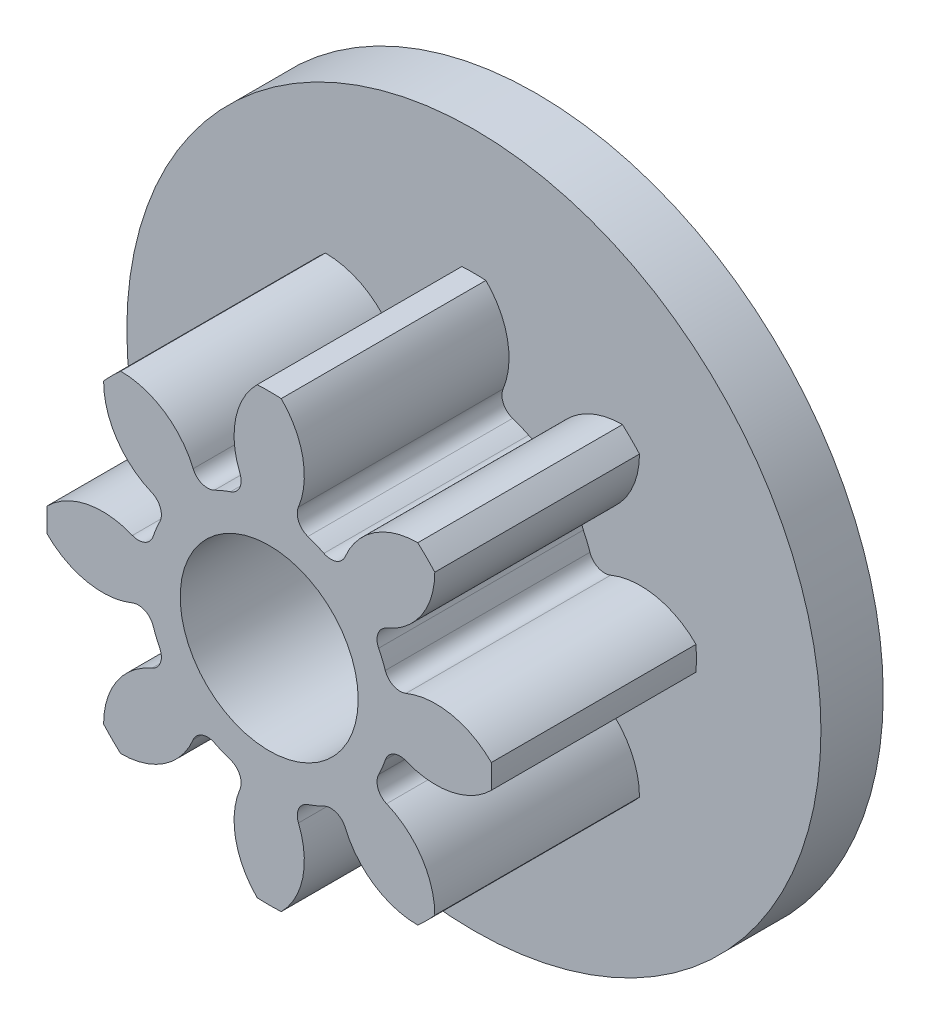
ISO-10303-21;
HEADER;
FILE_DESCRIPTION(('STEP AP214'),'2;1');
FILE_NAME('part.step','',(''),(''),'','','');
FILE_SCHEMA(('AUTOMOTIVE_DESIGN { 1 0 10303 214 1 1 1 1 }'));
ENDSEC;
DATA;
#1=APPLICATION_CONTEXT('core data for automotive mechanical design processes');
#2=APPLICATION_PROTOCOL_DEFINITION('international standard','automotive_design',2000,#1);
#3=PRODUCT_CONTEXT('',#1,'mechanical');
#4=PRODUCT('Part','Part','',(#3));
#5=PRODUCT_RELATED_PRODUCT_CATEGORY('part','',(#4));
#6=PRODUCT_DEFINITION_FORMATION('','',#4);
#7=PRODUCT_DEFINITION_CONTEXT('part definition',#1,'design');
#8=PRODUCT_DEFINITION('design','',#6,#7);
#9=PRODUCT_DEFINITION_SHAPE('','',#8);
#10=(LENGTH_UNIT() NAMED_UNIT(*) SI_UNIT(.MILLI.,.METRE.));
#11=(NAMED_UNIT(*) PLANE_ANGLE_UNIT() SI_UNIT($,.RADIAN.));
#12=(NAMED_UNIT(*) SI_UNIT($,.STERADIAN.) SOLID_ANGLE_UNIT());
#13=UNCERTAINTY_MEASURE_WITH_UNIT(LENGTH_MEASURE(1.E-05),#10,'distance_accuracy_value','');
#14=(GEOMETRIC_REPRESENTATION_CONTEXT(3) GLOBAL_UNCERTAINTY_ASSIGNED_CONTEXT((#13)) GLOBAL_UNIT_ASSIGNED_CONTEXT((#10,
#11,#12)) REPRESENTATION_CONTEXT('',''));
#15=CARTESIAN_POINT('',(0.,0.,0.));
#16=DIRECTION('',(0.,0.,1.));
#17=DIRECTION('',(1.,0.,0.));
#18=AXIS2_PLACEMENT_3D('',#15,#16,#17);
#19=CARTESIAN_POINT('',(-1.37870691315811,-0.560352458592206,2.3));
#20=DIRECTION('',(0.,0.,1.));
#21=DIRECTION('',(1.,0.,0.));
#22=AXIS2_PLACEMENT_3D('',#19,#20,#21);
#23=PLANE('',#22);
#24=CARTESIAN_POINT('',(0.288732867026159,0.419550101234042,2.3));
#25=DIRECTION('',(0.,0.,1.));
#26=DIRECTION('',(0.707106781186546,-0.707106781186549,0.));
#27=AXIS2_PLACEMENT_3D('',#24,#25,#26);
#28=CIRCLE('',#27,0.880913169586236);
#29=CARTESIAN_POINT('',(0.290836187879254,1.30046075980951,2.3));
#30=VERTEX_POINT('',#29);
#31=CARTESIAN_POINT('',(-0.524258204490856,0.758745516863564,2.3));
#32=VERTEX_POINT('',#31);
#33=EDGE_CURVE('E543',#30,#32,#28,.T.);
#34=ORIENTED_EDGE('',*,*,#33,.T.);
#35=CARTESIAN_POINT('',(-0.685764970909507,0.826129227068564,2.3));
#36=DIRECTION('',(0.,0.,1.));
#37=DIRECTION('',(1.,0.,0.));
#38=AXIS2_PLACEMENT_3D('',#35,#36,#37);
#39=CIRCLE('',#38,0.175);
#40=CARTESIAN_POINT('',(-0.764000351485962,0.669590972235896,2.3));
#41=VERTEX_POINT('',#40);
#42=EDGE_CURVE('E466',#32,#41,#39,.F.);
#43=ORIENTED_EDGE('',*,*,#42,.T.);
#44=CARTESIAN_POINT('',(-1.37870691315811,-0.560352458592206,2.3));
#45=DIRECTION('',(0.,0.,1.));
#46=DIRECTION('',(1.,0.,0.));
#47=AXIS2_PLACEMENT_3D('',#44,#45,#46);
#48=CIRCLE('',#47,1.375);
#49=CARTESIAN_POINT('',(-0.943668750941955,0.744012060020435,2.3));
#50=VERTEX_POINT('',#49);
#51=EDGE_CURVE('E524',#41,#50,#48,.T.);
#52=ORIENTED_EDGE('',*,*,#51,.T.);
#53=CARTESIAN_POINT('',(-0.88830025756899,0.910022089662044,2.3));
#54=DIRECTION('',(0.,0.,1.));
#55=DIRECTION('',(1.,0.,0.));
#56=AXIS2_PLACEMENT_3D('',#53,#54,#55);
#57=CIRCLE('',#56,0.175);
#58=CARTESIAN_POINT('',(-1.05015026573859,0.97657714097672,2.3));
#59=VERTEX_POINT('',#58);
#60=EDGE_CURVE('E493',#50,#59,#57,.F.);
#61=ORIENTED_EDGE('',*,*,#60,.T.);
#62=CARTESIAN_POINT('',(-1.86486914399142,1.3116012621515,2.3));
#63=DIRECTION('',(0.,0.,-1.));
#64=DIRECTION('',(-1.,0.,0.));
#65=AXIS2_PLACEMENT_3D('',#62,#63,#64);
#66=CIRCLE('',#65,0.880913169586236);
#67=CARTESIAN_POINT('',(-1.24345851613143,1.93598643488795,2.3));
#68=VERTEX_POINT('',#67);
#69=EDGE_CURVE('E521',#68,#59,#66,.T.);
#70=ORIENTED_EDGE('',*,*,#69,.F.);
#71=CARTESIAN_POINT('',(-1.37870691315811,-0.560352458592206,2.3));
#72=DIRECTION('',(0.,0.,1.));
#73=DIRECTION('',(1.,0.,0.));
#74=AXIS2_PLACEMENT_3D('',#71,#72,#73);
#75=CIRCLE('',#74,2.5);
#76=CARTESIAN_POINT('',(-1.51395531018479,1.93598643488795,2.3));
#77=VERTEX_POINT('',#76);
#78=EDGE_CURVE('E519',#68,#77,#75,.T.);
#79=ORIENTED_EDGE('',*,*,#78,.T.);
#80=CARTESIAN_POINT('',(-0.892544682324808,1.3116012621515,2.3));
#81=DIRECTION('',(0.,0.,1.));
#82=DIRECTION('',(1.,0.,0.));
#83=AXIS2_PLACEMENT_3D('',#80,#81,#82);
#84=CIRCLE('',#83,0.880913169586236);
#85=CARTESIAN_POINT('',(-1.70726356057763,0.97657714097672,2.3));
#86=VERTEX_POINT('',#85);
#87=EDGE_CURVE('E516',#77,#86,#84,.T.);
#88=ORIENTED_EDGE('',*,*,#87,.T.);
#89=CARTESIAN_POINT('',(-1.86911356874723,0.910022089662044,2.3));
#90=DIRECTION('',(0.,0.,1.));
#91=DIRECTION('',(1.,0.,0.));
#92=AXIS2_PLACEMENT_3D('',#89,#90,#91);
#93=CIRCLE('',#92,0.175);
#94=CARTESIAN_POINT('',(-1.81374507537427,0.744012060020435,2.3));
#95=VERTEX_POINT('',#94);
#96=EDGE_CURVE('E487',#86,#95,#93,.F.);
#97=ORIENTED_EDGE('',*,*,#96,.T.);
#98=CARTESIAN_POINT('',(-1.37870691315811,-0.560352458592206,2.3));
#99=DIRECTION('',(0.,0.,-1.));
#100=DIRECTION('',(-1.,0.,0.));
#101=AXIS2_PLACEMENT_3D('',#98,#99,#100);
#102=CIRCLE('',#101,1.375);
#103=CARTESIAN_POINT('',(-1.99341347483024,0.669590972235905,2.3));
#104=VERTEX_POINT('',#103);
#105=EDGE_CURVE('E514',#104,#95,#102,.T.);
#106=ORIENTED_EDGE('',*,*,#105,.F.);
#107=CARTESIAN_POINT('',(-2.0716488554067,0.826129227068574,2.3));
#108=DIRECTION('',(0.,0.,1.));
#109=DIRECTION('',(1.,0.,0.));
#110=AXIS2_PLACEMENT_3D('',#107,#108,#109);
#111=CIRCLE('',#110,0.175);
#112=CARTESIAN_POINT('',(-2.23315562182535,0.758745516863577,2.3));
#113=VERTEX_POINT('',#112);
#114=EDGE_CURVE('E351',#104,#113,#111,.F.);
#115=ORIENTED_EDGE('',*,*,#114,.T.);
#116=CARTESIAN_POINT('',(-3.04614669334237,0.419550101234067,2.3));
#117=DIRECTION('',(0.,0.,-1.));
#118=DIRECTION('',(-0.707106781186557,-0.707106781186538,0.));
#119=AXIS2_PLACEMENT_3D('',#116,#117,#118);
#120=CIRCLE('',#119,0.880913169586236);
#121=CARTESIAN_POINT('',(-3.04825001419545,1.30046075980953,2.3));
#122=VERTEX_POINT('',#121);
#123=EDGE_CURVE('E343',#122,#113,#120,.T.);
#124=ORIENTED_EDGE('',*,*,#123,.F.);
#125=CARTESIAN_POINT('',(-1.37870691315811,-0.560352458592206,2.3));
#126=DIRECTION('',(0.,0.,1.));
#127=DIRECTION('',(0.707106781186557,0.707106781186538,0.));
#128=AXIS2_PLACEMENT_3D('',#125,#126,#127);
#129=CIRCLE('',#128,2.5);
#130=CARTESIAN_POINT('',(-3.23952013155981,1.10919064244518,2.3));
#131=VERTEX_POINT('',#130);
#132=EDGE_CURVE('E686',#122,#131,#129,.T.);
#133=ORIENTED_EDGE('',*,*,#132,.T.);
#134=CARTESIAN_POINT('',(-2.35860947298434,1.10708732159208,2.3));
#135=DIRECTION('',(0.,0.,1.));
#136=DIRECTION('',(0.707106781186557,0.707106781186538,0.));
#137=AXIS2_PLACEMENT_3D('',#134,#135,#136);
#138=CIRCLE('',#137,0.880913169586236);
#139=CARTESIAN_POINT('',(-2.69780488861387,0.294096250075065,2.3));
#140=VERTEX_POINT('',#139);
#141=EDGE_CURVE('E684',#131,#140,#138,.T.);
#142=ORIENTED_EDGE('',*,*,#141,.T.);
#143=CARTESIAN_POINT('',(-2.76518859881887,0.132589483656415,2.3));
#144=DIRECTION('',(0.,0.,1.));
#145=DIRECTION('',(1.,0.,0.));
#146=AXIS2_PLACEMENT_3D('',#143,#144,#145);
#147=CIRCLE('',#146,0.175);
#148=CARTESIAN_POINT('',(-2.60865034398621,0.0543541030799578,2.3));
#149=VERTEX_POINT('',#148);
#150=EDGE_CURVE('E11',#140,#149,#147,.F.);
#151=ORIENTED_EDGE('',*,*,#150,.T.);
#152=CARTESIAN_POINT('',(-1.37870691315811,-0.560352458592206,2.3));
#153=DIRECTION('',(0.,0.,1.));
#154=DIRECTION('',(0.,1.,0.));
#155=AXIS2_PLACEMENT_3D('',#152,#153,#154);
#156=CIRCLE('',#155,1.375);
#157=CARTESIAN_POINT('',(-2.68307143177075,-0.125314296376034,2.3));
#158=VERTEX_POINT('',#157);
#159=EDGE_CURVE('E671',#149,#158,#156,.T.);
#160=ORIENTED_EDGE('',*,*,#159,.T.);
#161=CARTESIAN_POINT('',(-2.84908146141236,-0.069945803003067,2.3));
#162=DIRECTION('',(0.,0.,1.));
#163=DIRECTION('',(1.,0.,0.));
#164=AXIS2_PLACEMENT_3D('',#161,#162,#163);
#165=CIRCLE('',#164,0.175);
#166=CARTESIAN_POINT('',(-2.91563651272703,-0.23179581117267,2.3));
#167=VERTEX_POINT('',#166);
#168=EDGE_CURVE('E367',#158,#167,#165,.F.);
#169=ORIENTED_EDGE('',*,*,#168,.T.);
#170=CARTESIAN_POINT('',(-3.25066063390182,-1.04651468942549,2.3));
#171=DIRECTION('',(0.,0.,-1.));
#172=DIRECTION('',(0.,-1.,0.));
#173=AXIS2_PLACEMENT_3D('',#170,#171,#172);
#174=CIRCLE('',#173,0.880913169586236);
#175=CARTESIAN_POINT('',(-3.87504580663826,-0.425104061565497,2.3));
#176=VERTEX_POINT('',#175);
#177=EDGE_CURVE('E668',#176,#167,#174,.T.);
#178=ORIENTED_EDGE('',*,*,#177,.F.);
#179=CARTESIAN_POINT('',(-1.37870691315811,-0.560352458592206,2.3));
#180=DIRECTION('',(0.,0.,1.));
#181=DIRECTION('',(0.,1.,0.));
#182=AXIS2_PLACEMENT_3D('',#179,#180,#181);
#183=CIRCLE('',#182,2.5);
#184=CARTESIAN_POINT('',(-3.87504580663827,-0.695600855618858,2.3));
#185=VERTEX_POINT('',#184);
#186=EDGE_CURVE('E666',#176,#185,#183,.T.);
#187=ORIENTED_EDGE('',*,*,#186,.T.);
#188=CARTESIAN_POINT('',(-3.25066063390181,-0.0741902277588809,2.3));
#189=DIRECTION('',(0.,0.,1.));
#190=DIRECTION('',(0.,1.,0.));
#191=AXIS2_PLACEMENT_3D('',#188,#189,#190);
#192=CIRCLE('',#191,0.880913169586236);
#193=CARTESIAN_POINT('',(-2.91563651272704,-0.888909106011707,2.3));
#194=VERTEX_POINT('',#193);
#195=EDGE_CURVE('E663',#185,#194,#192,.T.);
#196=ORIENTED_EDGE('',*,*,#195,.T.);
#197=CARTESIAN_POINT('',(-2.84908146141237,-1.05075911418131,2.3));
#198=DIRECTION('',(0.,0.,1.));
#199=DIRECTION('',(1.,0.,0.));
#200=AXIS2_PLACEMENT_3D('',#197,#198,#199);
#201=CIRCLE('',#200,0.175);
#202=CARTESIAN_POINT('',(-2.68307143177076,-0.995390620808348,2.3));
#203=VERTEX_POINT('',#202);
#204=EDGE_CURVE('E362',#194,#203,#201,.F.);
#205=ORIENTED_EDGE('',*,*,#204,.T.);
#206=CARTESIAN_POINT('',(-1.37870691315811,-0.560352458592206,2.3));
#207=DIRECTION('',(0.,0.,1.));
#208=DIRECTION('',(-0.707106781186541,0.707106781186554,0.));
#209=AXIS2_PLACEMENT_3D('',#206,#207,#208);
#210=CIRCLE('',#209,1.375);
#211=CARTESIAN_POINT('',(-2.60865034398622,-1.17505902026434,2.3));
#212=VERTEX_POINT('',#211);
#213=EDGE_CURVE('E647',#203,#212,#210,.T.);
#214=ORIENTED_EDGE('',*,*,#213,.T.);
#215=CARTESIAN_POINT('',(-2.76518859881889,-1.2532944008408,2.3));
#216=DIRECTION('',(0.,0.,1.));
#217=DIRECTION('',(1.,0.,0.));
#218=AXIS2_PLACEMENT_3D('',#215,#216,#217);
#219=CIRCLE('',#218,0.175);
#220=CARTESIAN_POINT('',(-2.69780488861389,-1.41480116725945,2.3));
#221=VERTEX_POINT('',#220);
#222=EDGE_CURVE('E387',#212,#221,#219,.F.);
#223=ORIENTED_EDGE('',*,*,#222,.T.);
#224=CARTESIAN_POINT('',(-2.35860947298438,-2.22779223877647,2.3));
#225=DIRECTION('',(0.,0.,-1.));
#226=DIRECTION('',(0.707106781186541,-0.707106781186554,0.));
#227=AXIS2_PLACEMENT_3D('',#224,#225,#226);
#228=CIRCLE('',#227,0.880913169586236);
#229=CARTESIAN_POINT('',(-3.23952013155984,-2.22989555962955,2.3));
#230=VERTEX_POINT('',#229);
#231=EDGE_CURVE('E644',#230,#221,#228,.T.);
#232=ORIENTED_EDGE('',*,*,#231,.F.);
#233=CARTESIAN_POINT('',(-1.37870691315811,-0.560352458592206,2.3));
#234=DIRECTION('',(0.,0.,1.));
#235=DIRECTION('',(-0.707106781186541,0.707106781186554,0.));
#236=AXIS2_PLACEMENT_3D('',#233,#234,#235);
#237=CIRCLE('',#236,2.5);
#238=CARTESIAN_POINT('',(-3.04825001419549,-2.42116567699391,2.3));
#239=VERTEX_POINT('',#238);
#240=EDGE_CURVE('E642',#230,#239,#237,.T.);
#241=ORIENTED_EDGE('',*,*,#240,.T.);
#242=CARTESIAN_POINT('',(-3.04614669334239,-1.54025501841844,2.3));
#243=DIRECTION('',(0.,0.,1.));
#244=DIRECTION('',(-0.707106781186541,0.707106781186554,0.));
#245=AXIS2_PLACEMENT_3D('',#242,#243,#244);
#246=CIRCLE('',#245,0.880913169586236);
#247=CARTESIAN_POINT('',(-2.23315562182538,-1.87945043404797,2.3));
#248=VERTEX_POINT('',#247);
#249=EDGE_CURVE('E639',#239,#248,#246,.T.);
#250=ORIENTED_EDGE('',*,*,#249,.T.);
#251=CARTESIAN_POINT('',(-2.07164885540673,-1.94683414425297,2.3));
#252=DIRECTION('',(0.,0.,1.));
#253=DIRECTION('',(1.,0.,0.));
#254=AXIS2_PLACEMENT_3D('',#251,#252,#253);
#255=CIRCLE('',#254,0.175);
#256=CARTESIAN_POINT('',(-1.99341347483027,-1.7902958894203,2.3));
#257=VERTEX_POINT('',#256);
#258=EDGE_CURVE('E382',#248,#257,#255,.F.);
#259=ORIENTED_EDGE('',*,*,#258,.T.);
#260=CARTESIAN_POINT('',(-1.37870691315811,-0.560352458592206,2.3));
#261=DIRECTION('',(0.,0.,1.));
#262=DIRECTION('',(-1.,0.,0.));
#263=AXIS2_PLACEMENT_3D('',#260,#261,#262);
#264=CIRCLE('',#263,1.375);
#265=CARTESIAN_POINT('',(-1.81374507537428,-1.86471697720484,2.3));
#266=VERTEX_POINT('',#265);
#267=EDGE_CURVE('E623',#257,#266,#264,.T.);
#268=ORIENTED_EDGE('',*,*,#267,.T.);
#269=CARTESIAN_POINT('',(-1.86911356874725,-2.03072700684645,2.3));
#270=DIRECTION('',(0.,0.,1.));
#271=DIRECTION('',(1.,0.,0.));
#272=AXIS2_PLACEMENT_3D('',#269,#270,#271);
#273=CIRCLE('',#272,0.175);
#274=CARTESIAN_POINT('',(-1.70726356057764,-2.09728205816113,2.3));
#275=VERTEX_POINT('',#274);
#276=EDGE_CURVE('E408',#266,#275,#273,.F.);
#277=ORIENTED_EDGE('',*,*,#276,.T.);
#278=CARTESIAN_POINT('',(-0.892544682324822,-2.43230617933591,2.3));
#279=DIRECTION('',(0.,0.,-1.));
#280=DIRECTION('',(1.,0.,0.));
#281=AXIS2_PLACEMENT_3D('',#278,#279,#280);
#282=CIRCLE('',#281,0.880913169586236);
#283=CARTESIAN_POINT('',(-1.51395531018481,-3.05669135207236,2.3));
#284=VERTEX_POINT('',#283);
#285=EDGE_CURVE('E620',#284,#275,#282,.T.);
#286=ORIENTED_EDGE('',*,*,#285,.F.);
#287=CARTESIAN_POINT('',(-1.37870691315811,-0.560352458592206,2.3));
#288=DIRECTION('',(0.,0.,1.));
#289=DIRECTION('',(-1.,0.,0.));
#290=AXIS2_PLACEMENT_3D('',#287,#288,#289);
#291=CIRCLE('',#290,2.5);
#292=CARTESIAN_POINT('',(-1.24345851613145,-3.05669135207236,2.3));
#293=VERTEX_POINT('',#292);
#294=EDGE_CURVE('E618',#284,#293,#291,.T.);
#295=ORIENTED_EDGE('',*,*,#294,.T.);
#296=CARTESIAN_POINT('',(-1.86486914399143,-2.4323061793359,2.3));
#297=DIRECTION('',(0.,0.,1.));
#298=DIRECTION('',(-1.,0.,0.));
#299=AXIS2_PLACEMENT_3D('',#296,#297,#298);
#300=CIRCLE('',#299,0.880913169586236);
#301=CARTESIAN_POINT('',(-1.05015026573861,-2.09728205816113,2.3));
#302=VERTEX_POINT('',#301);
#303=EDGE_CURVE('E615',#293,#302,#300,.T.);
#304=ORIENTED_EDGE('',*,*,#303,.T.);
#305=CARTESIAN_POINT('',(-0.888300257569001,-2.03072700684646,2.3));
#306=DIRECTION('',(0.,0.,1.));
#307=DIRECTION('',(1.,0.,0.));
#308=AXIS2_PLACEMENT_3D('',#305,#306,#307);
#309=CIRCLE('',#308,0.175);
#310=CARTESIAN_POINT('',(-0.943668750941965,-1.86471697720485,2.3));
#311=VERTEX_POINT('',#310);
#312=EDGE_CURVE('E403',#302,#311,#309,.F.);
#313=ORIENTED_EDGE('',*,*,#312,.T.);
#314=CARTESIAN_POINT('',(-1.37870691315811,-0.560352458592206,2.3));
#315=DIRECTION('',(0.,0.,1.));
#316=DIRECTION('',(-0.707106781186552,-0.707106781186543,0.));
#317=AXIS2_PLACEMENT_3D('',#314,#315,#316);
#318=CIRCLE('',#317,1.375);
#319=CARTESIAN_POINT('',(-0.764000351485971,-1.79029588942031,2.3));
#320=VERTEX_POINT('',#319);
#321=EDGE_CURVE('E599',#311,#320,#318,.T.);
#322=ORIENTED_EDGE('',*,*,#321,.T.);
#323=CARTESIAN_POINT('',(-0.685764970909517,-1.94683414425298,2.3));
#324=DIRECTION('',(0.,0.,1.));
#325=DIRECTION('',(1.,0.,0.));
#326=AXIS2_PLACEMENT_3D('',#323,#324,#325);
#327=CIRCLE('',#326,0.175);
#328=CARTESIAN_POINT('',(-0.524258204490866,-1.87945043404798,2.3));
#329=VERTEX_POINT('',#328);
#330=EDGE_CURVE('E429',#320,#329,#327,.F.);
#331=ORIENTED_EDGE('',*,*,#330,.T.);
#332=CARTESIAN_POINT('',(0.288732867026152,-1.54025501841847,2.3));
#333=DIRECTION('',(0.,0.,-1.));
#334=DIRECTION('',(0.707106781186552,0.707106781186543,0.));
#335=AXIS2_PLACEMENT_3D('',#332,#333,#334);
#336=CIRCLE('',#335,0.880913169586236);
#337=CARTESIAN_POINT('',(0.29083618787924,-2.42116567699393,2.3));
#338=VERTEX_POINT('',#337);
#339=EDGE_CURVE('E596',#338,#329,#336,.T.);
#340=ORIENTED_EDGE('',*,*,#339,.F.);
#341=CARTESIAN_POINT('',(-1.37870691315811,-0.560352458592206,2.3));
#342=DIRECTION('',(0.,0.,1.));
#343=DIRECTION('',(-0.707106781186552,-0.707106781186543,0.));
#344=AXIS2_PLACEMENT_3D('',#341,#342,#343);
#345=CIRCLE('',#344,2.5);
#346=CARTESIAN_POINT('',(0.482106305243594,-2.22989555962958,2.3));
#347=VERTEX_POINT('',#346);
#348=EDGE_CURVE('E594',#338,#347,#345,.T.);
#349=ORIENTED_EDGE('',*,*,#348,.T.);
#350=CARTESIAN_POINT('',(-0.39880435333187,-2.22779223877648,2.3));
#351=DIRECTION('',(0.,0.,1.));
#352=DIRECTION('',(-0.707106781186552,-0.707106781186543,0.));
#353=AXIS2_PLACEMENT_3D('',#350,#351,#352);
#354=CIRCLE('',#353,0.880913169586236);
#355=CARTESIAN_POINT('',(-0.0596089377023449,-1.41480116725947,2.3));
#356=VERTEX_POINT('',#355);
#357=EDGE_CURVE('E591',#347,#356,#354,.T.);
#358=ORIENTED_EDGE('',*,*,#357,.T.);
#359=CARTESIAN_POINT('',(0.00777477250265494,-1.25329440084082,2.3));
#360=DIRECTION('',(0.,0.,1.));
#361=DIRECTION('',(1.,0.,0.));
#362=AXIS2_PLACEMENT_3D('',#359,#360,#361);
#363=CIRCLE('',#362,0.175);
#364=CARTESIAN_POINT('',(-0.148763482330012,-1.17505902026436,2.3));
#365=VERTEX_POINT('',#364);
#366=EDGE_CURVE('E424',#356,#365,#363,.F.);
#367=ORIENTED_EDGE('',*,*,#366,.T.);
#368=CARTESIAN_POINT('',(-1.37870691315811,-0.560352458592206,2.3));
#369=DIRECTION('',(0.,0.,1.));
#370=DIRECTION('',(0.,-1.,0.));
#371=AXIS2_PLACEMENT_3D('',#368,#369,#370);
#372=CIRCLE('',#371,1.375);
#373=CARTESIAN_POINT('',(-0.0743423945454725,-0.995390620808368,2.3));
#374=VERTEX_POINT('',#373);
#375=EDGE_CURVE('E575',#365,#374,#372,.T.);
#376=ORIENTED_EDGE('',*,*,#375,.T.);
#377=CARTESIAN_POINT('',(0.0916676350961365,-1.05075911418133,2.3));
#378=DIRECTION('',(0.,0.,1.));
#379=DIRECTION('',(1.,0.,0.));
#380=AXIS2_PLACEMENT_3D('',#377,#378,#379);
#381=CIRCLE('',#380,0.175);
#382=CARTESIAN_POINT('',(0.158222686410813,-0.88890910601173,2.3));
#383=VERTEX_POINT('',#382);
#384=EDGE_CURVE('E450',#374,#383,#381,.F.);
#385=ORIENTED_EDGE('',*,*,#384,.T.);
#386=CARTESIAN_POINT('',(0.493246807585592,-0.074190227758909,2.3));
#387=DIRECTION('',(0.,0.,-1.));
#388=DIRECTION('',(0.,1.,0.));
#389=AXIS2_PLACEMENT_3D('',#386,#387,#388);
#390=CIRCLE('',#389,0.880913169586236);
#391=CARTESIAN_POINT('',(1.11763198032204,-0.695600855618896,2.3));
#392=VERTEX_POINT('',#391);
#393=EDGE_CURVE('E572',#392,#383,#390,.T.);
#394=ORIENTED_EDGE('',*,*,#393,.F.);
#395=CARTESIAN_POINT('',(-1.37870691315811,-0.560352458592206,2.3));
#396=DIRECTION('',(0.,0.,1.));
#397=DIRECTION('',(0.,-1.,0.));
#398=AXIS2_PLACEMENT_3D('',#395,#396,#397);
#399=CIRCLE('',#398,2.5);
#400=CARTESIAN_POINT('',(1.11763198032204,-0.425104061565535,2.3));
#401=VERTEX_POINT('',#400);
#402=EDGE_CURVE('E570',#392,#401,#399,.T.);
#403=ORIENTED_EDGE('',*,*,#402,.T.);
#404=CARTESIAN_POINT('',(0.493246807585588,-1.04651468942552,2.3));
#405=DIRECTION('',(0.,0.,1.));
#406=DIRECTION('',(0.,-1.,0.));
#407=AXIS2_PLACEMENT_3D('',#404,#405,#406);
#408=CIRCLE('',#407,0.880913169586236);
#409=CARTESIAN_POINT('',(0.158222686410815,-0.231795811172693,2.3));
#410=VERTEX_POINT('',#409);
#411=EDGE_CURVE('E567',#401,#410,#408,.T.);
#412=ORIENTED_EDGE('',*,*,#411,.T.);
#413=CARTESIAN_POINT('',(0.0916676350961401,-0.0699458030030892,2.3));
#414=DIRECTION('',(0.,0.,1.));
#415=DIRECTION('',(1.,0.,0.));
#416=AXIS2_PLACEMENT_3D('',#413,#414,#415);
#417=CIRCLE('',#416,0.175);
#418=CARTESIAN_POINT('',(-0.074342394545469,-0.125314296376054,2.3));
#419=VERTEX_POINT('',#418);
#420=EDGE_CURVE('E445',#410,#419,#417,.F.);
#421=ORIENTED_EDGE('',*,*,#420,.T.);
#422=CARTESIAN_POINT('',(-1.37870691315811,-0.560352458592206,2.3));
#423=DIRECTION('',(0.,0.,1.));
#424=DIRECTION('',(0.707106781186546,-0.707106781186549,0.));
#425=AXIS2_PLACEMENT_3D('',#422,#423,#424);
#426=CIRCLE('',#425,1.375);
#427=CARTESIAN_POINT('',(-0.148763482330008,0.0543541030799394,2.3));
#428=VERTEX_POINT('',#427);
#429=EDGE_CURVE('E551',#419,#428,#426,.T.);
#430=ORIENTED_EDGE('',*,*,#429,.T.);
#431=CARTESIAN_POINT('',(0.00777477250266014,0.132589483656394,2.3));
#432=DIRECTION('',(0.,0.,1.));
#433=DIRECTION('',(1.,0.,0.));
#434=AXIS2_PLACEMENT_3D('',#431,#432,#433);
#435=CIRCLE('',#434,0.175);
#436=CARTESIAN_POINT('',(-0.0596089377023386,0.294096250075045,2.3));
#437=VERTEX_POINT('',#436);
#438=EDGE_CURVE('E471',#428,#437,#435,.F.);
#439=ORIENTED_EDGE('',*,*,#438,.T.);
#440=CARTESIAN_POINT('',(-0.398804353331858,1.10708732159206,2.3));
#441=DIRECTION('',(0.,0.,-1.));
#442=DIRECTION('',(-0.707106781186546,0.707106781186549,0.));
#443=AXIS2_PLACEMENT_3D('',#440,#441,#442);
#444=CIRCLE('',#443,0.880913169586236);
#445=CARTESIAN_POINT('',(0.482106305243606,1.10919064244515,2.3));
#446=VERTEX_POINT('',#445);
#447=EDGE_CURVE('E548',#446,#437,#444,.T.);
#448=ORIENTED_EDGE('',*,*,#447,.F.);
#449=CARTESIAN_POINT('',(-1.37870691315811,-0.560352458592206,2.3));
#450=DIRECTION('',(0.,0.,1.));
#451=DIRECTION('',(0.707106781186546,-0.707106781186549,0.));
#452=AXIS2_PLACEMENT_3D('',#449,#450,#451);
#453=CIRCLE('',#452,2.5);
#454=EDGE_CURVE('E546',#446,#30,#453,.T.);
#455=ORIENTED_EDGE('',*,*,#454,.T.);
#456=EDGE_LOOP('',(#34,#43,#52,#61,#70,#79,#88,#97,#106,#115,#124,#133,#142,#151,#160,#169,#178,
#187,#196,#205,#214,#223,#232,#241,#250,#259,#268,#277,#286,#295,#304,#313,#322,#331,#340,#349,
#358,#367,#376,#385,#394,#403,#412,#421,#430,#439,#448,#455));
#457=FACE_BOUND('',#456,.T.);
#458=CARTESIAN_POINT('',(-1.37870691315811,-0.560352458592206,2.3));
#459=DIRECTION('',(0.,0.,1.));
#460=DIRECTION('',(1.,0.,0.));
#461=AXIS2_PLACEMENT_3D('',#458,#459,#460);
#462=CIRCLE('',#461,1.);
#463=CARTESIAN_POINT('',(-0.378706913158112,-0.560352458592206,2.3));
#464=VERTEX_POINT('',#463);
#465=EDGE_CURVE('E700',#464,#464,#462,.T.);
#466=ORIENTED_EDGE('',*,*,#465,.F.);
#467=EDGE_LOOP('',(#466));
#468=FACE_BOUND('',#467,.T.);
#469=ADVANCED_FACE('F26',(#457,#468),#23,.T.);
#470=CARTESIAN_POINT('',(-1.37870691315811,-0.560352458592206,-0.7));
#471=DIRECTION('',(0.,0.,-1.));
#472=DIRECTION('',(-1.,0.,0.));
#473=AXIS2_PLACEMENT_3D('',#470,#471,#472);
#474=PLANE('',#473);
#475=CARTESIAN_POINT('',(-1.37870691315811,-0.560352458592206,-0.7));
#476=DIRECTION('',(0.,0.,-1.));
#477=DIRECTION('',(-1.,0.,0.));
#478=AXIS2_PLACEMENT_3D('',#475,#476,#477);
#479=CIRCLE('',#478,3.9);
#480=CARTESIAN_POINT('',(-5.27870691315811,-0.560352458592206,-0.7));
#481=VERTEX_POINT('',#480);
#482=EDGE_CURVE('E694',#481,#481,#479,.T.);
#483=ORIENTED_EDGE('',*,*,#482,.T.);
#484=EDGE_LOOP('',(#483));
#485=FACE_BOUND('',#484,.T.);
#486=CARTESIAN_POINT('',(-1.37870691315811,-0.560352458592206,-0.7));
#487=DIRECTION('',(0.,0.,1.));
#488=DIRECTION('',(1.,0.,0.));
#489=AXIS2_PLACEMENT_3D('',#486,#487,#488);
#490=CIRCLE('',#489,1.);
#491=CARTESIAN_POINT('',(-0.378706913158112,-0.560352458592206,-0.7));
#492=VERTEX_POINT('',#491);
#493=EDGE_CURVE('E703',#492,#492,#490,.T.);
#494=ORIENTED_EDGE('',*,*,#493,.T.);
#495=EDGE_LOOP('',(#494));
#496=FACE_BOUND('',#495,.T.);
#497=ADVANCED_FACE('F707',(#485,#496),#474,.T.);
#498=CARTESIAN_POINT('',(-1.37870691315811,-0.560352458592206,2.3));
#499=DIRECTION('',(0.,0.,-1.));
#500=DIRECTION('',(-1.,0.,0.));
#501=AXIS2_PLACEMENT_3D('',#498,#499,#500);
#502=CYLINDRICAL_SURFACE('',#501,1.375);
#503=ORIENTED_EDGE('',*,*,#51,.F.);
#504=DIRECTION('',(0.,0.,-1.));
#505=VECTOR('',#504,1.);
#506=CARTESIAN_POINT('',(-0.764000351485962,0.669590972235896,2.3));
#507=LINE('',#506,#505);
#508=CARTESIAN_POINT('',(-0.764000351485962,0.669590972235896,0.));
#509=VERTEX_POINT('',#508);
#510=EDGE_CURVE('E478',#41,#509,#507,.T.);
#511=ORIENTED_EDGE('',*,*,#510,.T.);
#512=CARTESIAN_POINT('',(-1.37870691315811,-0.560352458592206,0.));
#513=DIRECTION('',(0.,0.,1.));
#514=DIRECTION('',(1.,0.,0.));
#515=AXIS2_PLACEMENT_3D('',#512,#513,#514);
#516=CIRCLE('',#515,1.375);
#517=CARTESIAN_POINT('',(-0.943668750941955,0.744012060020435,0.));
#518=VERTEX_POINT('',#517);
#519=EDGE_CURVE('E536',#509,#518,#516,.T.);
#520=ORIENTED_EDGE('',*,*,#519,.T.);
#521=DIRECTION('',(0.,0.,-1.));
#522=VECTOR('',#521,1.);
#523=CARTESIAN_POINT('',(-0.943668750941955,0.744012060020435,2.3));
#524=LINE('',#523,#522);
#525=EDGE_CURVE('E503',#518,#50,#524,.F.);
#526=ORIENTED_EDGE('',*,*,#525,.T.);
#527=EDGE_LOOP('',(#503,#511,#520,#526));
#528=FACE_BOUND('',#527,.T.);
#529=ADVANCED_FACE('F28',(#528),#502,.T.);
#530=CARTESIAN_POINT('',(-1.86486914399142,1.3116012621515,2.3));
#531=DIRECTION('',(0.,0.,-1.));
#532=DIRECTION('',(-1.,0.,0.));
#533=AXIS2_PLACEMENT_3D('',#530,#531,#532);
#534=CYLINDRICAL_SURFACE('',#533,0.880913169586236);
#535=ORIENTED_EDGE('',*,*,#69,.T.);
#536=DIRECTION('',(0.,0.,-1.));
#537=VECTOR('',#536,1.);
#538=CARTESIAN_POINT('',(-1.05015026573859,0.97657714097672,2.3));
#539=LINE('',#538,#537);
#540=CARTESIAN_POINT('',(-1.05015026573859,0.97657714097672,0.));
#541=VERTEX_POINT('',#540);
#542=EDGE_CURVE('E506',#59,#541,#539,.T.);
#543=ORIENTED_EDGE('',*,*,#542,.T.);
#544=CARTESIAN_POINT('',(-1.86486914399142,1.3116012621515,0.));
#545=DIRECTION('',(0.,0.,-1.));
#546=DIRECTION('',(-1.,0.,0.));
#547=AXIS2_PLACEMENT_3D('',#544,#545,#546);
#548=CIRCLE('',#547,0.880913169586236);
#549=CARTESIAN_POINT('',(-1.24345851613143,1.93598643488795,0.));
#550=VERTEX_POINT('',#549);
#551=EDGE_CURVE('E533',#550,#541,#548,.T.);
#552=ORIENTED_EDGE('',*,*,#551,.F.);
#553=DIRECTION('',(0.,0.,-1.));
#554=VECTOR('',#553,1.);
#555=CARTESIAN_POINT('',(-1.24345851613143,1.93598643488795,2.3));
#556=LINE('',#555,#554);
#557=EDGE_CURVE('E509',#68,#550,#556,.T.);
#558=ORIENTED_EDGE('',*,*,#557,.F.);
#559=EDGE_LOOP('',(#535,#543,#552,#558));
#560=FACE_BOUND('',#559,.T.);
#561=ADVANCED_FACE('F742',(#560),#534,.T.);
#562=CARTESIAN_POINT('',(-1.37870691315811,-0.560352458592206,2.3));
#563=DIRECTION('',(0.,0.,-1.));
#564=DIRECTION('',(-1.,0.,0.));
#565=AXIS2_PLACEMENT_3D('',#562,#563,#564);
#566=CYLINDRICAL_SURFACE('',#565,2.5);
#567=CARTESIAN_POINT('',(-1.37870691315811,-0.560352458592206,0.));
#568=DIRECTION('',(0.,0.,1.));
#569=DIRECTION('',(1.,0.,0.));
#570=AXIS2_PLACEMENT_3D('',#567,#568,#569);
#571=CIRCLE('',#570,2.5);
#572=CARTESIAN_POINT('',(-1.51395531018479,1.93598643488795,0.));
#573=VERTEX_POINT('',#572);
#574=EDGE_CURVE('E531',#550,#573,#571,.T.);
#575=ORIENTED_EDGE('',*,*,#574,.T.);
#576=DIRECTION('',(0.,0.,-1.));
#577=VECTOR('',#576,1.);
#578=CARTESIAN_POINT('',(-1.51395531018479,1.93598643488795,2.3));
#579=LINE('',#578,#577);
#580=EDGE_CURVE('E511',#77,#573,#579,.T.);
#581=ORIENTED_EDGE('',*,*,#580,.F.);
#582=ORIENTED_EDGE('',*,*,#78,.F.);
#583=ORIENTED_EDGE('',*,*,#557,.T.);
#584=EDGE_LOOP('',(#575,#581,#582,#583));
#585=FACE_BOUND('',#584,.T.);
#586=ADVANCED_FACE('F739',(#585),#566,.T.);
#587=CARTESIAN_POINT('',(-0.892544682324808,1.3116012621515,2.3));
#588=DIRECTION('',(0.,0.,-1.));
#589=DIRECTION('',(-1.,0.,0.));
#590=AXIS2_PLACEMENT_3D('',#587,#588,#589);
#591=CYLINDRICAL_SURFACE('',#590,0.880913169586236);
#592=CARTESIAN_POINT('',(-0.892544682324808,1.3116012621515,0.));
#593=DIRECTION('',(0.,0.,1.));
#594=DIRECTION('',(1.,0.,0.));
#595=AXIS2_PLACEMENT_3D('',#592,#593,#594);
#596=CIRCLE('',#595,0.880913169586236);
#597=CARTESIAN_POINT('',(-1.70726356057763,0.97657714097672,0.));
#598=VERTEX_POINT('',#597);
#599=EDGE_CURVE('E529',#573,#598,#596,.T.);
#600=ORIENTED_EDGE('',*,*,#599,.T.);
#601=DIRECTION('',(0.,0.,-1.));
#602=VECTOR('',#601,1.);
#603=CARTESIAN_POINT('',(-1.70726356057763,0.97657714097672,2.3));
#604=LINE('',#603,#602);
#605=EDGE_CURVE('E498',#598,#86,#604,.F.);
#606=ORIENTED_EDGE('',*,*,#605,.T.);
#607=ORIENTED_EDGE('',*,*,#87,.F.);
#608=ORIENTED_EDGE('',*,*,#580,.T.);
#609=EDGE_LOOP('',(#600,#606,#607,#608));
#610=FACE_BOUND('',#609,.T.);
#611=ADVANCED_FACE('F735',(#610),#591,.T.);
#612=CARTESIAN_POINT('',(-1.37870691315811,-0.560352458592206,2.3));
#613=DIRECTION('',(0.,0.,-1.));
#614=DIRECTION('',(-1.,0.,0.));
#615=AXIS2_PLACEMENT_3D('',#612,#613,#614);
#616=CYLINDRICAL_SURFACE('',#615,1.375);
#617=CARTESIAN_POINT('',(-1.37870691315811,-0.560352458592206,0.));
#618=DIRECTION('',(0.,0.,-1.));
#619=DIRECTION('',(-1.,0.,0.));
#620=AXIS2_PLACEMENT_3D('',#617,#618,#619);
#621=CIRCLE('',#620,1.375);
#622=CARTESIAN_POINT('',(-1.99341347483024,0.669590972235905,0.));
#623=VERTEX_POINT('',#622);
#624=CARTESIAN_POINT('',(-1.81374507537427,0.744012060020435,0.));
#625=VERTEX_POINT('',#624);
#626=EDGE_CURVE('E526',#623,#625,#621,.T.);
#627=ORIENTED_EDGE('',*,*,#626,.F.);
#628=DIRECTION('',(0.,0.,-1.));
#629=VECTOR('',#628,1.);
#630=CARTESIAN_POINT('',(-1.99341347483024,0.669590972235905,2.3));
#631=LINE('',#630,#629);
#632=EDGE_CURVE('E357',#623,#104,#631,.F.);
#633=ORIENTED_EDGE('',*,*,#632,.T.);
#634=ORIENTED_EDGE('',*,*,#105,.T.);
#635=DIRECTION('',(0.,0.,-1.));
#636=VECTOR('',#635,1.);
#637=CARTESIAN_POINT('',(-1.81374507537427,0.744012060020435,2.3));
#638=LINE('',#637,#636);
#639=EDGE_CURVE('E500',#95,#625,#638,.T.);
#640=ORIENTED_EDGE('',*,*,#639,.T.);
#641=EDGE_LOOP('',(#627,#633,#634,#640));
#642=FACE_BOUND('',#641,.T.);
#643=ADVANCED_FACE('F732',(#642),#616,.T.);
#644=CARTESIAN_POINT('',(-0.88830025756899,0.910022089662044,2.3));
#645=DIRECTION('',(0.,0.,1.));
#646=DIRECTION('',(1.,0.,0.));
#647=AXIS2_PLACEMENT_3D('',#644,#645,#646);
#648=CYLINDRICAL_SURFACE('',#647,0.175);
#649=ORIENTED_EDGE('',*,*,#60,.F.);
#650=ORIENTED_EDGE('',*,*,#525,.F.);
#651=CARTESIAN_POINT('',(-0.88830025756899,0.910022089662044,0.));
#652=DIRECTION('',(0.,0.,1.));
#653=DIRECTION('',(1.,0.,0.));
#654=AXIS2_PLACEMENT_3D('',#651,#652,#653);
#655=CIRCLE('',#654,0.175);
#656=EDGE_CURVE('E495',#541,#518,#655,.T.);
#657=ORIENTED_EDGE('',*,*,#656,.F.);
#658=ORIENTED_EDGE('',*,*,#542,.F.);
#659=EDGE_LOOP('',(#649,#650,#657,#658));
#660=FACE_BOUND('',#659,.T.);
#661=ADVANCED_FACE('F730',(#660),#648,.F.);
#662=CARTESIAN_POINT('',(-1.86911356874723,0.910022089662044,2.3));
#663=DIRECTION('',(0.,0.,1.));
#664=DIRECTION('',(1.,0.,0.));
#665=AXIS2_PLACEMENT_3D('',#662,#663,#664);
#666=CYLINDRICAL_SURFACE('',#665,0.175);
#667=ORIENTED_EDGE('',*,*,#96,.F.);
#668=ORIENTED_EDGE('',*,*,#605,.F.);
#669=CARTESIAN_POINT('',(-1.86911356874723,0.910022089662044,0.));
#670=DIRECTION('',(0.,0.,1.));
#671=DIRECTION('',(1.,0.,0.));
#672=AXIS2_PLACEMENT_3D('',#669,#670,#671);
#673=CIRCLE('',#672,0.175);
#674=EDGE_CURVE('E490',#625,#598,#673,.T.);
#675=ORIENTED_EDGE('',*,*,#674,.F.);
#676=ORIENTED_EDGE('',*,*,#639,.F.);
#677=EDGE_LOOP('',(#667,#668,#675,#676));
#678=FACE_BOUND('',#677,.T.);
#679=ADVANCED_FACE('F767',(#678),#666,.F.);
#680=CARTESIAN_POINT('',(-1.37870691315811,-0.560352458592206,2.3));
#681=DIRECTION('',(0.,0.,-1.));
#682=DIRECTION('',(-1.,0.,0.));
#683=AXIS2_PLACEMENT_3D('',#680,#681,#682);
#684=CYLINDRICAL_SURFACE('',#683,1.375);
#685=ORIENTED_EDGE('',*,*,#429,.F.);
#686=DIRECTION('',(0.,0.,-1.));
#687=VECTOR('',#686,1.);
#688=CARTESIAN_POINT('',(-0.0743423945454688,-0.125314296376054,2.3));
#689=LINE('',#688,#687);
#690=CARTESIAN_POINT('',(-0.074342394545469,-0.125314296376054,0.));
#691=VERTEX_POINT('',#690);
#692=EDGE_CURVE('E457',#419,#691,#689,.T.);
#693=ORIENTED_EDGE('',*,*,#692,.T.);
#694=CARTESIAN_POINT('',(-1.37870691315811,-0.560352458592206,0.));
#695=DIRECTION('',(0.,0.,1.));
#696=DIRECTION('',(0.707106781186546,-0.707106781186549,0.));
#697=AXIS2_PLACEMENT_3D('',#694,#695,#696);
#698=CIRCLE('',#697,1.375);
#699=CARTESIAN_POINT('',(-0.148763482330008,0.0543541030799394,0.));
#700=VERTEX_POINT('',#699);
#701=EDGE_CURVE('E560',#691,#700,#698,.T.);
#702=ORIENTED_EDGE('',*,*,#701,.T.);
#703=DIRECTION('',(0.,0.,-1.));
#704=VECTOR('',#703,1.);
#705=CARTESIAN_POINT('',(-0.148763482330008,0.0543541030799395,2.3));
#706=LINE('',#705,#704);
#707=EDGE_CURVE('E481',#700,#428,#706,.F.);
#708=ORIENTED_EDGE('',*,*,#707,.T.);
#709=EDGE_LOOP('',(#685,#693,#702,#708));
#710=FACE_BOUND('',#709,.T.);
#711=ADVANCED_FACE('F882',(#710),#684,.T.);
#712=CARTESIAN_POINT('',(-0.398804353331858,1.10708732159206,2.3));
#713=DIRECTION('',(0.,0.,-1.));
#714=DIRECTION('',(-1.,0.,0.));
#715=AXIS2_PLACEMENT_3D('',#712,#713,#714);
#716=CYLINDRICAL_SURFACE('',#715,0.880913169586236);
#717=ORIENTED_EDGE('',*,*,#447,.T.);
#718=DIRECTION('',(0.,0.,-1.));
#719=VECTOR('',#718,1.);
#720=CARTESIAN_POINT('',(-0.0596089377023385,0.294096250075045,2.3));
#721=LINE('',#720,#719);
#722=CARTESIAN_POINT('',(-0.0596089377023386,0.294096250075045,0.));
#723=VERTEX_POINT('',#722);
#724=EDGE_CURVE('E484',#437,#723,#721,.T.);
#725=ORIENTED_EDGE('',*,*,#724,.T.);
#726=CARTESIAN_POINT('',(-0.398804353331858,1.10708732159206,0.));
#727=DIRECTION('',(0.,0.,-1.));
#728=DIRECTION('',(-0.707106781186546,0.707106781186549,0.));
#729=AXIS2_PLACEMENT_3D('',#726,#727,#728);
#730=CIRCLE('',#729,0.880913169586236);
#731=CARTESIAN_POINT('',(0.482106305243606,1.10919064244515,0.));
#732=VERTEX_POINT('',#731);
#733=EDGE_CURVE('E557',#732,#723,#730,.T.);
#734=ORIENTED_EDGE('',*,*,#733,.F.);
#735=DIRECTION('',(0.,0.,-1.));
#736=VECTOR('',#735,1.);
#737=CARTESIAN_POINT('',(0.482106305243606,1.10919064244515,2.3));
#738=LINE('',#737,#736);
#739=EDGE_CURVE('E538',#446,#732,#738,.T.);
#740=ORIENTED_EDGE('',*,*,#739,.F.);
#741=EDGE_LOOP('',(#717,#725,#734,#740));
#742=FACE_BOUND('',#741,.T.);
#743=ADVANCED_FACE('F878',(#742),#716,.T.);
#744=CARTESIAN_POINT('',(-1.37870691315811,-0.560352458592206,2.3));
#745=DIRECTION('',(0.,0.,-1.));
#746=DIRECTION('',(-1.,0.,0.));
#747=AXIS2_PLACEMENT_3D('',#744,#745,#746);
#748=CYLINDRICAL_SURFACE('',#747,2.5);
#749=CARTESIAN_POINT('',(-1.37870691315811,-0.560352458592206,0.));
#750=DIRECTION('',(0.,0.,1.));
#751=DIRECTION('',(0.707106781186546,-0.707106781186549,0.));
#752=AXIS2_PLACEMENT_3D('',#749,#750,#751);
#753=CIRCLE('',#752,2.5);
#754=CARTESIAN_POINT('',(0.290836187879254,1.30046075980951,0.));
#755=VERTEX_POINT('',#754);
#756=EDGE_CURVE('E555',#732,#755,#753,.T.);
#757=ORIENTED_EDGE('',*,*,#756,.T.);
#758=DIRECTION('',(0.,0.,-1.));
#759=VECTOR('',#758,1.);
#760=CARTESIAN_POINT('',(0.290836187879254,1.30046075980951,2.3));
#761=LINE('',#760,#759);
#762=EDGE_CURVE('E540',#30,#755,#761,.T.);
#763=ORIENTED_EDGE('',*,*,#762,.F.);
#764=ORIENTED_EDGE('',*,*,#454,.F.);
#765=ORIENTED_EDGE('',*,*,#739,.T.);
#766=EDGE_LOOP('',(#757,#763,#764,#765));
#767=FACE_BOUND('',#766,.T.);
#768=ADVANCED_FACE('F874',(#767),#748,.T.);
#769=CARTESIAN_POINT('',(0.288732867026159,0.419550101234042,2.3));
#770=DIRECTION('',(0.,0.,-1.));
#771=DIRECTION('',(-1.,0.,0.));
#772=AXIS2_PLACEMENT_3D('',#769,#770,#771);
#773=CYLINDRICAL_SURFACE('',#772,0.880913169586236);
#774=CARTESIAN_POINT('',(0.288732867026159,0.419550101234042,0.));
#775=DIRECTION('',(0.,0.,1.));
#776=DIRECTION('',(0.707106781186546,-0.707106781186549,0.));
#777=AXIS2_PLACEMENT_3D('',#774,#775,#776);
#778=CIRCLE('',#777,0.880913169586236);
#779=CARTESIAN_POINT('',(-0.524258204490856,0.758745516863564,0.));
#780=VERTEX_POINT('',#779);
#781=EDGE_CURVE('E553',#755,#780,#778,.T.);
#782=ORIENTED_EDGE('',*,*,#781,.T.);
#783=DIRECTION('',(0.,0.,-1.));
#784=VECTOR('',#783,1.);
#785=CARTESIAN_POINT('',(-0.524258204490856,0.758745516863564,2.3));
#786=LINE('',#785,#784);
#787=EDGE_CURVE('E476',#780,#32,#786,.F.);
#788=ORIENTED_EDGE('',*,*,#787,.T.);
#789=ORIENTED_EDGE('',*,*,#33,.F.);
#790=ORIENTED_EDGE('',*,*,#762,.T.);
#791=EDGE_LOOP('',(#782,#788,#789,#790));
#792=FACE_BOUND('',#791,.T.);
#793=ADVANCED_FACE('F870',(#792),#773,.T.);
#794=CARTESIAN_POINT('',(-1.37870691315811,-0.560352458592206,2.3));
#795=DIRECTION('',(0.,0.,-1.));
#796=DIRECTION('',(-1.,0.,0.));
#797=AXIS2_PLACEMENT_3D('',#794,#795,#796);
#798=CYLINDRICAL_SURFACE('',#797,1.375);
#799=ORIENTED_EDGE('',*,*,#375,.F.);
#800=DIRECTION('',(0.,0.,-1.));
#801=VECTOR('',#800,1.);
#802=CARTESIAN_POINT('',(-0.148763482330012,-1.17505902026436,2.3));
#803=LINE('',#802,#801);
#804=CARTESIAN_POINT('',(-0.148763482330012,-1.17505902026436,0.));
#805=VERTEX_POINT('',#804);
#806=EDGE_CURVE('E436',#365,#805,#803,.T.);
#807=ORIENTED_EDGE('',*,*,#806,.T.);
#808=CARTESIAN_POINT('',(-1.37870691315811,-0.560352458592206,0.));
#809=DIRECTION('',(0.,0.,1.));
#810=DIRECTION('',(0.,-1.,0.));
#811=AXIS2_PLACEMENT_3D('',#808,#809,#810);
#812=CIRCLE('',#811,1.375);
#813=CARTESIAN_POINT('',(-0.0743423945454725,-0.995390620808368,0.));
#814=VERTEX_POINT('',#813);
#815=EDGE_CURVE('E584',#805,#814,#812,.T.);
#816=ORIENTED_EDGE('',*,*,#815,.T.);
#817=DIRECTION('',(0.,0.,-1.));
#818=VECTOR('',#817,1.);
#819=CARTESIAN_POINT('',(-0.0743423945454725,-0.995390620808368,2.3));
#820=LINE('',#819,#818);
#821=EDGE_CURVE('E460',#814,#374,#820,.F.);
#822=ORIENTED_EDGE('',*,*,#821,.T.);
#823=EDGE_LOOP('',(#799,#807,#816,#822));
#824=FACE_BOUND('',#823,.T.);
#825=ADVANCED_FACE('F866',(#824),#798,.T.);
#826=CARTESIAN_POINT('',(0.493246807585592,-0.074190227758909,2.3));
#827=DIRECTION('',(0.,0.,-1.));
#828=DIRECTION('',(-1.,0.,0.));
#829=AXIS2_PLACEMENT_3D('',#826,#827,#828);
#830=CYLINDRICAL_SURFACE('',#829,0.880913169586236);
#831=ORIENTED_EDGE('',*,*,#393,.T.);
#832=DIRECTION('',(0.,0.,-1.));
#833=VECTOR('',#832,1.);
#834=CARTESIAN_POINT('',(0.158222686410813,-0.88890910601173,2.3));
#835=LINE('',#834,#833);
#836=CARTESIAN_POINT('',(0.158222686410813,-0.88890910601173,0.));
#837=VERTEX_POINT('',#836);
#838=EDGE_CURVE('E463',#383,#837,#835,.T.);
#839=ORIENTED_EDGE('',*,*,#838,.T.);
#840=CARTESIAN_POINT('',(0.493246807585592,-0.074190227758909,0.));
#841=DIRECTION('',(0.,0.,-1.));
#842=DIRECTION('',(0.,1.,0.));
#843=AXIS2_PLACEMENT_3D('',#840,#841,#842);
#844=CIRCLE('',#843,0.880913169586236);
#845=CARTESIAN_POINT('',(1.11763198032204,-0.695600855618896,0.));
#846=VERTEX_POINT('',#845);
#847=EDGE_CURVE('E581',#846,#837,#844,.T.);
#848=ORIENTED_EDGE('',*,*,#847,.F.);
#849=DIRECTION('',(0.,0.,-1.));
#850=VECTOR('',#849,1.);
#851=CARTESIAN_POINT('',(1.11763198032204,-0.695600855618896,2.3));
#852=LINE('',#851,#850);
#853=EDGE_CURVE('E562',#392,#846,#852,.T.);
#854=ORIENTED_EDGE('',*,*,#853,.F.);
#855=EDGE_LOOP('',(#831,#839,#848,#854));
#856=FACE_BOUND('',#855,.T.);
#857=ADVANCED_FACE('F862',(#856),#830,.T.);
#858=CARTESIAN_POINT('',(-1.37870691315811,-0.560352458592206,2.3));
#859=DIRECTION('',(0.,0.,-1.));
#860=DIRECTION('',(-1.,0.,0.));
#861=AXIS2_PLACEMENT_3D('',#858,#859,#860);
#862=CYLINDRICAL_SURFACE('',#861,2.5);
#863=CARTESIAN_POINT('',(-1.37870691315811,-0.560352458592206,0.));
#864=DIRECTION('',(0.,0.,1.));
#865=DIRECTION('',(0.,-1.,0.));
#866=AXIS2_PLACEMENT_3D('',#863,#864,#865);
#867=CIRCLE('',#866,2.5);
#868=CARTESIAN_POINT('',(1.11763198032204,-0.425104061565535,0.));
#869=VERTEX_POINT('',#868);
#870=EDGE_CURVE('E579',#846,#869,#867,.T.);
#871=ORIENTED_EDGE('',*,*,#870,.T.);
#872=DIRECTION('',(0.,0.,-1.));
#873=VECTOR('',#872,1.);
#874=CARTESIAN_POINT('',(1.11763198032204,-0.425104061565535,2.3));
#875=LINE('',#874,#873);
#876=EDGE_CURVE('E564',#401,#869,#875,.T.);
#877=ORIENTED_EDGE('',*,*,#876,.F.);
#878=ORIENTED_EDGE('',*,*,#402,.F.);
#879=ORIENTED_EDGE('',*,*,#853,.T.);
#880=EDGE_LOOP('',(#871,#877,#878,#879));
#881=FACE_BOUND('',#880,.T.);
#882=ADVANCED_FACE('F858',(#881),#862,.T.);
#883=CARTESIAN_POINT('',(0.493246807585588,-1.04651468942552,2.3));
#884=DIRECTION('',(0.,0.,-1.));
#885=DIRECTION('',(-1.,0.,0.));
#886=AXIS2_PLACEMENT_3D('',#883,#884,#885);
#887=CYLINDRICAL_SURFACE('',#886,0.880913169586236);
#888=CARTESIAN_POINT('',(0.493246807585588,-1.04651468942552,0.));
#889=DIRECTION('',(0.,0.,1.));
#890=DIRECTION('',(0.,-1.,0.));
#891=AXIS2_PLACEMENT_3D('',#888,#889,#890);
#892=CIRCLE('',#891,0.880913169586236);
#893=CARTESIAN_POINT('',(0.158222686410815,-0.231795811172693,0.));
#894=VERTEX_POINT('',#893);
#895=EDGE_CURVE('E577',#869,#894,#892,.T.);
#896=ORIENTED_EDGE('',*,*,#895,.T.);
#897=DIRECTION('',(0.,0.,-1.));
#898=VECTOR('',#897,1.);
#899=CARTESIAN_POINT('',(0.158222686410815,-0.231795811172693,2.3));
#900=LINE('',#899,#898);
#901=EDGE_CURVE('E455',#894,#410,#900,.F.);
#902=ORIENTED_EDGE('',*,*,#901,.T.);
#903=ORIENTED_EDGE('',*,*,#411,.F.);
#904=ORIENTED_EDGE('',*,*,#876,.T.);
#905=EDGE_LOOP('',(#896,#902,#903,#904));
#906=FACE_BOUND('',#905,.T.);
#907=ADVANCED_FACE('F854',(#906),#887,.T.);
#908=CARTESIAN_POINT('',(-1.37870691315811,-0.560352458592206,2.3));
#909=DIRECTION('',(0.,0.,-1.));
#910=DIRECTION('',(-1.,0.,0.));
#911=AXIS2_PLACEMENT_3D('',#908,#909,#910);
#912=CYLINDRICAL_SURFACE('',#911,1.375);
#913=ORIENTED_EDGE('',*,*,#321,.F.);
#914=DIRECTION('',(0.,0.,-1.));
#915=VECTOR('',#914,1.);
#916=CARTESIAN_POINT('',(-0.943668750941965,-1.86471697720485,2.3));
#917=LINE('',#916,#915);
#918=CARTESIAN_POINT('',(-0.943668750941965,-1.86471697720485,0.));
#919=VERTEX_POINT('',#918);
#920=EDGE_CURVE('E415',#311,#919,#917,.T.);
#921=ORIENTED_EDGE('',*,*,#920,.T.);
#922=CARTESIAN_POINT('',(-1.37870691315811,-0.560352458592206,0.));
#923=DIRECTION('',(0.,0.,1.));
#924=DIRECTION('',(-0.707106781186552,-0.707106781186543,0.));
#925=AXIS2_PLACEMENT_3D('',#922,#923,#924);
#926=CIRCLE('',#925,1.375);
#927=CARTESIAN_POINT('',(-0.764000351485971,-1.79029588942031,0.));
#928=VERTEX_POINT('',#927);
#929=EDGE_CURVE('E608',#919,#928,#926,.T.);
#930=ORIENTED_EDGE('',*,*,#929,.T.);
#931=DIRECTION('',(0.,0.,-1.));
#932=VECTOR('',#931,1.);
#933=CARTESIAN_POINT('',(-0.764000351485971,-1.79029588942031,2.3));
#934=LINE('',#933,#932);
#935=EDGE_CURVE('E439',#928,#320,#934,.F.);
#936=ORIENTED_EDGE('',*,*,#935,.T.);
#937=EDGE_LOOP('',(#913,#921,#930,#936));
#938=FACE_BOUND('',#937,.T.);
#939=ADVANCED_FACE('F850',(#938),#912,.T.);
#940=CARTESIAN_POINT('',(0.288732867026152,-1.54025501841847,2.3));
#941=DIRECTION('',(0.,0.,-1.));
#942=DIRECTION('',(-1.,0.,0.));
#943=AXIS2_PLACEMENT_3D('',#940,#941,#942);
#944=CYLINDRICAL_SURFACE('',#943,0.880913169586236);
#945=ORIENTED_EDGE('',*,*,#339,.T.);
#946=DIRECTION('',(0.,0.,-1.));
#947=VECTOR('',#946,1.);
#948=CARTESIAN_POINT('',(-0.524258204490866,-1.87945043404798,2.3));
#949=LINE('',#948,#947);
#950=CARTESIAN_POINT('',(-0.524258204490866,-1.87945043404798,0.));
#951=VERTEX_POINT('',#950);
#952=EDGE_CURVE('E442',#329,#951,#949,.T.);
#953=ORIENTED_EDGE('',*,*,#952,.T.);
#954=CARTESIAN_POINT('',(0.288732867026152,-1.54025501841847,0.));
#955=DIRECTION('',(0.,0.,-1.));
#956=DIRECTION('',(0.707106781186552,0.707106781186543,0.));
#957=AXIS2_PLACEMENT_3D('',#954,#955,#956);
#958=CIRCLE('',#957,0.880913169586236);
#959=CARTESIAN_POINT('',(0.29083618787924,-2.42116567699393,0.));
#960=VERTEX_POINT('',#959);
#961=EDGE_CURVE('E605',#960,#951,#958,.T.);
#962=ORIENTED_EDGE('',*,*,#961,.F.);
#963=DIRECTION('',(0.,0.,-1.));
#964=VECTOR('',#963,1.);
#965=CARTESIAN_POINT('',(0.29083618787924,-2.42116567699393,2.3));
#966=LINE('',#965,#964);
#967=EDGE_CURVE('E586',#338,#960,#966,.T.);
#968=ORIENTED_EDGE('',*,*,#967,.F.);
#969=EDGE_LOOP('',(#945,#953,#962,#968));
#970=FACE_BOUND('',#969,.T.);
#971=ADVANCED_FACE('F846',(#970),#944,.T.);
#972=CARTESIAN_POINT('',(-1.37870691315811,-0.560352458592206,2.3));
#973=DIRECTION('',(0.,0.,-1.));
#974=DIRECTION('',(-1.,0.,0.));
#975=AXIS2_PLACEMENT_3D('',#972,#973,#974);
#976=CYLINDRICAL_SURFACE('',#975,2.5);
#977=CARTESIAN_POINT('',(-1.37870691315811,-0.560352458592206,0.));
#978=DIRECTION('',(0.,0.,1.));
#979=DIRECTION('',(-0.707106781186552,-0.707106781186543,0.));
#980=AXIS2_PLACEMENT_3D('',#977,#978,#979);
#981=CIRCLE('',#980,2.5);
#982=CARTESIAN_POINT('',(0.482106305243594,-2.22989555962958,0.));
#983=VERTEX_POINT('',#982);
#984=EDGE_CURVE('E603',#960,#983,#981,.T.);
#985=ORIENTED_EDGE('',*,*,#984,.T.);
#986=DIRECTION('',(0.,0.,-1.));
#987=VECTOR('',#986,1.);
#988=CARTESIAN_POINT('',(0.482106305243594,-2.22989555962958,2.3));
#989=LINE('',#988,#987);
#990=EDGE_CURVE('E588',#347,#983,#989,.T.);
#991=ORIENTED_EDGE('',*,*,#990,.F.);
#992=ORIENTED_EDGE('',*,*,#348,.F.);
#993=ORIENTED_EDGE('',*,*,#967,.T.);
#994=EDGE_LOOP('',(#985,#991,#992,#993));
#995=FACE_BOUND('',#994,.T.);
#996=ADVANCED_FACE('F842',(#995),#976,.T.);
#997=CARTESIAN_POINT('',(-0.39880435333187,-2.22779223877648,2.3));
#998=DIRECTION('',(0.,0.,-1.));
#999=DIRECTION('',(-1.,0.,0.));
#1000=AXIS2_PLACEMENT_3D('',#997,#998,#999);
#1001=CYLINDRICAL_SURFACE('',#1000,0.880913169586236);
#1002=CARTESIAN_POINT('',(-0.39880435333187,-2.22779223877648,0.));
#1003=DIRECTION('',(0.,0.,1.));
#1004=DIRECTION('',(-0.707106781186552,-0.707106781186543,0.));
#1005=AXIS2_PLACEMENT_3D('',#1002,#1003,#1004);
#1006=CIRCLE('',#1005,0.880913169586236);
#1007=CARTESIAN_POINT('',(-0.0596089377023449,-1.41480116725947,0.));
#1008=VERTEX_POINT('',#1007);
#1009=EDGE_CURVE('E601',#983,#1008,#1006,.T.);
#1010=ORIENTED_EDGE('',*,*,#1009,.T.);
#1011=DIRECTION('',(0.,0.,-1.));
#1012=VECTOR('',#1011,1.);
#1013=CARTESIAN_POINT('',(-0.0596089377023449,-1.41480116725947,2.3));
#1014=LINE('',#1013,#1012);
#1015=EDGE_CURVE('E434',#1008,#356,#1014,.F.);
#1016=ORIENTED_EDGE('',*,*,#1015,.T.);
#1017=ORIENTED_EDGE('',*,*,#357,.F.);
#1018=ORIENTED_EDGE('',*,*,#990,.T.);
#1019=EDGE_LOOP('',(#1010,#1016,#1017,#1018));
#1020=FACE_BOUND('',#1019,.T.);
#1021=ADVANCED_FACE('F838',(#1020),#1001,.T.);
#1022=CARTESIAN_POINT('',(-1.37870691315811,-0.560352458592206,2.3));
#1023=DIRECTION('',(0.,0.,-1.));
#1024=DIRECTION('',(-1.,0.,0.));
#1025=AXIS2_PLACEMENT_3D('',#1022,#1023,#1024);
#1026=CYLINDRICAL_SURFACE('',#1025,1.375);
#1027=ORIENTED_EDGE('',*,*,#267,.F.);
#1028=DIRECTION('',(0.,0.,-1.));
#1029=VECTOR('',#1028,1.);
#1030=CARTESIAN_POINT('',(-1.99341347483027,-1.7902958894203,2.3));
#1031=LINE('',#1030,#1029);
#1032=CARTESIAN_POINT('',(-1.99341347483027,-1.7902958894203,0.));
#1033=VERTEX_POINT('',#1032);
#1034=EDGE_CURVE('E394',#257,#1033,#1031,.T.);
#1035=ORIENTED_EDGE('',*,*,#1034,.T.);
#1036=CARTESIAN_POINT('',(-1.37870691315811,-0.560352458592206,0.));
#1037=DIRECTION('',(0.,0.,1.));
#1038=DIRECTION('',(-1.,0.,0.));
#1039=AXIS2_PLACEMENT_3D('',#1036,#1037,#1038);
#1040=CIRCLE('',#1039,1.375);
#1041=CARTESIAN_POINT('',(-1.81374507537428,-1.86471697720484,0.));
#1042=VERTEX_POINT('',#1041);
#1043=EDGE_CURVE('E632',#1033,#1042,#1040,.T.);
#1044=ORIENTED_EDGE('',*,*,#1043,.T.);
#1045=DIRECTION('',(0.,0.,-1.));
#1046=VECTOR('',#1045,1.);
#1047=CARTESIAN_POINT('',(-1.81374507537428,-1.86471697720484,2.3));
#1048=LINE('',#1047,#1046);
#1049=EDGE_CURVE('E418',#1042,#266,#1048,.F.);
#1050=ORIENTED_EDGE('',*,*,#1049,.T.);
#1051=EDGE_LOOP('',(#1027,#1035,#1044,#1050));
#1052=FACE_BOUND('',#1051,.T.);
#1053=ADVANCED_FACE('F834',(#1052),#1026,.T.);
#1054=CARTESIAN_POINT('',(-0.892544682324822,-2.43230617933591,2.3));
#1055=DIRECTION('',(0.,0.,-1.));
#1056=DIRECTION('',(-1.,0.,0.));
#1057=AXIS2_PLACEMENT_3D('',#1054,#1055,#1056);
#1058=CYLINDRICAL_SURFACE('',#1057,0.880913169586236);
#1059=ORIENTED_EDGE('',*,*,#285,.T.);
#1060=DIRECTION('',(0.,0.,-1.));
#1061=VECTOR('',#1060,1.);
#1062=CARTESIAN_POINT('',(-1.70726356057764,-2.09728205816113,2.3));
#1063=LINE('',#1062,#1061);
#1064=CARTESIAN_POINT('',(-1.70726356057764,-2.09728205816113,0.));
#1065=VERTEX_POINT('',#1064);
#1066=EDGE_CURVE('E421',#275,#1065,#1063,.T.);
#1067=ORIENTED_EDGE('',*,*,#1066,.T.);
#1068=CARTESIAN_POINT('',(-0.892544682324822,-2.43230617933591,0.));
#1069=DIRECTION('',(0.,0.,-1.));
#1070=DIRECTION('',(1.,0.,0.));
#1071=AXIS2_PLACEMENT_3D('',#1068,#1069,#1070);
#1072=CIRCLE('',#1071,0.880913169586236);
#1073=CARTESIAN_POINT('',(-1.51395531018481,-3.05669135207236,0.));
#1074=VERTEX_POINT('',#1073);
#1075=EDGE_CURVE('E629',#1074,#1065,#1072,.T.);
#1076=ORIENTED_EDGE('',*,*,#1075,.F.);
#1077=DIRECTION('',(0.,0.,-1.));
#1078=VECTOR('',#1077,1.);
#1079=CARTESIAN_POINT('',(-1.51395531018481,-3.05669135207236,2.3));
#1080=LINE('',#1079,#1078);
#1081=EDGE_CURVE('E610',#284,#1074,#1080,.T.);
#1082=ORIENTED_EDGE('',*,*,#1081,.F.);
#1083=EDGE_LOOP('',(#1059,#1067,#1076,#1082));
#1084=FACE_BOUND('',#1083,.T.);
#1085=ADVANCED_FACE('F830',(#1084),#1058,.T.);
#1086=CARTESIAN_POINT('',(-1.37870691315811,-0.560352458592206,2.3));
#1087=DIRECTION('',(0.,0.,-1.));
#1088=DIRECTION('',(-1.,0.,0.));
#1089=AXIS2_PLACEMENT_3D('',#1086,#1087,#1088);
#1090=CYLINDRICAL_SURFACE('',#1089,2.5);
#1091=CARTESIAN_POINT('',(-1.37870691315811,-0.560352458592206,0.));
#1092=DIRECTION('',(0.,0.,1.));
#1093=DIRECTION('',(-1.,0.,0.));
#1094=AXIS2_PLACEMENT_3D('',#1091,#1092,#1093);
#1095=CIRCLE('',#1094,2.5);
#1096=CARTESIAN_POINT('',(-1.24345851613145,-3.05669135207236,0.));
#1097=VERTEX_POINT('',#1096);
#1098=EDGE_CURVE('E627',#1074,#1097,#1095,.T.);
#1099=ORIENTED_EDGE('',*,*,#1098,.T.);
#1100=DIRECTION('',(0.,0.,-1.));
#1101=VECTOR('',#1100,1.);
#1102=CARTESIAN_POINT('',(-1.24345851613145,-3.05669135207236,2.3));
#1103=LINE('',#1102,#1101);
#1104=EDGE_CURVE('E612',#293,#1097,#1103,.T.);
#1105=ORIENTED_EDGE('',*,*,#1104,.F.);
#1106=ORIENTED_EDGE('',*,*,#294,.F.);
#1107=ORIENTED_EDGE('',*,*,#1081,.T.);
#1108=EDGE_LOOP('',(#1099,#1105,#1106,#1107));
#1109=FACE_BOUND('',#1108,.T.);
#1110=ADVANCED_FACE('F826',(#1109),#1090,.T.);
#1111=CARTESIAN_POINT('',(-1.86486914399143,-2.4323061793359,2.3));
#1112=DIRECTION('',(0.,0.,-1.));
#1113=DIRECTION('',(-1.,0.,0.));
#1114=AXIS2_PLACEMENT_3D('',#1111,#1112,#1113);
#1115=CYLINDRICAL_SURFACE('',#1114,0.880913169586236);
#1116=CARTESIAN_POINT('',(-1.86486914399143,-2.4323061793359,0.));
#1117=DIRECTION('',(0.,0.,1.));
#1118=DIRECTION('',(-1.,0.,0.));
#1119=AXIS2_PLACEMENT_3D('',#1116,#1117,#1118);
#1120=CIRCLE('',#1119,0.880913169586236);
#1121=CARTESIAN_POINT('',(-1.05015026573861,-2.09728205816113,0.));
#1122=VERTEX_POINT('',#1121);
#1123=EDGE_CURVE('E625',#1097,#1122,#1120,.T.);
#1124=ORIENTED_EDGE('',*,*,#1123,.T.);
#1125=DIRECTION('',(0.,0.,-1.));
#1126=VECTOR('',#1125,1.);
#1127=CARTESIAN_POINT('',(-1.05015026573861,-2.09728205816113,2.3));
#1128=LINE('',#1127,#1126);
#1129=EDGE_CURVE('E413',#1122,#302,#1128,.F.);
#1130=ORIENTED_EDGE('',*,*,#1129,.T.);
#1131=ORIENTED_EDGE('',*,*,#303,.F.);
#1132=ORIENTED_EDGE('',*,*,#1104,.T.);
#1133=EDGE_LOOP('',(#1124,#1130,#1131,#1132));
#1134=FACE_BOUND('',#1133,.T.);
#1135=ADVANCED_FACE('F822',(#1134),#1115,.T.);
#1136=CARTESIAN_POINT('',(-1.37870691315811,-0.560352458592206,2.3));
#1137=DIRECTION('',(0.,0.,-1.));
#1138=DIRECTION('',(-1.,0.,0.));
#1139=AXIS2_PLACEMENT_3D('',#1136,#1137,#1138);
#1140=CYLINDRICAL_SURFACE('',#1139,1.375);
#1141=ORIENTED_EDGE('',*,*,#213,.F.);
#1142=DIRECTION('',(0.,0.,-1.));
#1143=VECTOR('',#1142,1.);
#1144=CARTESIAN_POINT('',(-2.68307143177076,-0.995390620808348,2.3));
#1145=LINE('',#1144,#1143);
#1146=CARTESIAN_POINT('',(-2.68307143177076,-0.995390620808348,0.));
#1147=VERTEX_POINT('',#1146);
#1148=EDGE_CURVE('E373',#203,#1147,#1145,.T.);
#1149=ORIENTED_EDGE('',*,*,#1148,.T.);
#1150=CARTESIAN_POINT('',(-1.37870691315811,-0.560352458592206,0.));
#1151=DIRECTION('',(0.,0.,1.));
#1152=DIRECTION('',(-0.707106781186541,0.707106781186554,0.));
#1153=AXIS2_PLACEMENT_3D('',#1150,#1151,#1152);
#1154=CIRCLE('',#1153,1.375);
#1155=CARTESIAN_POINT('',(-2.60865034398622,-1.17505902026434,0.));
#1156=VERTEX_POINT('',#1155);
#1157=EDGE_CURVE('E656',#1147,#1156,#1154,.T.);
#1158=ORIENTED_EDGE('',*,*,#1157,.T.);
#1159=DIRECTION('',(0.,0.,-1.));
#1160=VECTOR('',#1159,1.);
#1161=CARTESIAN_POINT('',(-2.60865034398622,-1.17505902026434,2.3));
#1162=LINE('',#1161,#1160);
#1163=EDGE_CURVE('E397',#1156,#212,#1162,.F.);
#1164=ORIENTED_EDGE('',*,*,#1163,.T.);
#1165=EDGE_LOOP('',(#1141,#1149,#1158,#1164));
#1166=FACE_BOUND('',#1165,.T.);
#1167=ADVANCED_FACE('F818',(#1166),#1140,.T.);
#1168=CARTESIAN_POINT('',(-2.35860947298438,-2.22779223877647,2.3));
#1169=DIRECTION('',(0.,0.,-1.));
#1170=DIRECTION('',(-1.,0.,0.));
#1171=AXIS2_PLACEMENT_3D('',#1168,#1169,#1170);
#1172=CYLINDRICAL_SURFACE('',#1171,0.880913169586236);
#1173=ORIENTED_EDGE('',*,*,#231,.T.);
#1174=DIRECTION('',(0.,0.,-1.));
#1175=VECTOR('',#1174,1.);
#1176=CARTESIAN_POINT('',(-2.69780488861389,-1.41480116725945,2.3));
#1177=LINE('',#1176,#1175);
#1178=CARTESIAN_POINT('',(-2.69780488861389,-1.41480116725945,0.));
#1179=VERTEX_POINT('',#1178);
#1180=EDGE_CURVE('E400',#221,#1179,#1177,.T.);
#1181=ORIENTED_EDGE('',*,*,#1180,.T.);
#1182=CARTESIAN_POINT('',(-2.35860947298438,-2.22779223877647,0.));
#1183=DIRECTION('',(0.,0.,-1.));
#1184=DIRECTION('',(0.707106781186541,-0.707106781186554,0.));
#1185=AXIS2_PLACEMENT_3D('',#1182,#1183,#1184);
#1186=CIRCLE('',#1185,0.880913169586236);
#1187=CARTESIAN_POINT('',(-3.23952013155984,-2.22989555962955,0.));
#1188=VERTEX_POINT('',#1187);
#1189=EDGE_CURVE('E653',#1188,#1179,#1186,.T.);
#1190=ORIENTED_EDGE('',*,*,#1189,.F.);
#1191=DIRECTION('',(0.,0.,-1.));
#1192=VECTOR('',#1191,1.);
#1193=CARTESIAN_POINT('',(-3.23952013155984,-2.22989555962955,2.3));
#1194=LINE('',#1193,#1192);
#1195=EDGE_CURVE('E634',#230,#1188,#1194,.T.);
#1196=ORIENTED_EDGE('',*,*,#1195,.F.);
#1197=EDGE_LOOP('',(#1173,#1181,#1190,#1196));
#1198=FACE_BOUND('',#1197,.T.);
#1199=ADVANCED_FACE('F814',(#1198),#1172,.T.);
#1200=CARTESIAN_POINT('',(-1.37870691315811,-0.560352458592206,2.3));
#1201=DIRECTION('',(0.,0.,-1.));
#1202=DIRECTION('',(-1.,0.,0.));
#1203=AXIS2_PLACEMENT_3D('',#1200,#1201,#1202);
#1204=CYLINDRICAL_SURFACE('',#1203,2.5);
#1205=CARTESIAN_POINT('',(-1.37870691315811,-0.560352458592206,0.));
#1206=DIRECTION('',(0.,0.,1.));
#1207=DIRECTION('',(-0.707106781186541,0.707106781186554,0.));
#1208=AXIS2_PLACEMENT_3D('',#1205,#1206,#1207);
#1209=CIRCLE('',#1208,2.5);
#1210=CARTESIAN_POINT('',(-3.04825001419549,-2.42116567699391,0.));
#1211=VERTEX_POINT('',#1210);
#1212=EDGE_CURVE('E651',#1188,#1211,#1209,.T.);
#1213=ORIENTED_EDGE('',*,*,#1212,.T.);
#1214=DIRECTION('',(0.,0.,-1.));
#1215=VECTOR('',#1214,1.);
#1216=CARTESIAN_POINT('',(-3.04825001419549,-2.42116567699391,2.3));
#1217=LINE('',#1216,#1215);
#1218=EDGE_CURVE('E636',#239,#1211,#1217,.T.);
#1219=ORIENTED_EDGE('',*,*,#1218,.F.);
#1220=ORIENTED_EDGE('',*,*,#240,.F.);
#1221=ORIENTED_EDGE('',*,*,#1195,.T.);
#1222=EDGE_LOOP('',(#1213,#1219,#1220,#1221));
#1223=FACE_BOUND('',#1222,.T.);
#1224=ADVANCED_FACE('F810',(#1223),#1204,.T.);
#1225=CARTESIAN_POINT('',(-3.04614669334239,-1.54025501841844,2.3));
#1226=DIRECTION('',(0.,0.,-1.));
#1227=DIRECTION('',(-1.,0.,0.));
#1228=AXIS2_PLACEMENT_3D('',#1225,#1226,#1227);
#1229=CYLINDRICAL_SURFACE('',#1228,0.880913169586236);
#1230=CARTESIAN_POINT('',(-3.04614669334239,-1.54025501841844,0.));
#1231=DIRECTION('',(0.,0.,1.));
#1232=DIRECTION('',(-0.707106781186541,0.707106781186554,0.));
#1233=AXIS2_PLACEMENT_3D('',#1230,#1231,#1232);
#1234=CIRCLE('',#1233,0.880913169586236);
#1235=CARTESIAN_POINT('',(-2.23315562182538,-1.87945043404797,0.));
#1236=VERTEX_POINT('',#1235);
#1237=EDGE_CURVE('E649',#1211,#1236,#1234,.T.);
#1238=ORIENTED_EDGE('',*,*,#1237,.T.);
#1239=DIRECTION('',(0.,0.,-1.));
#1240=VECTOR('',#1239,1.);
#1241=CARTESIAN_POINT('',(-2.23315562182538,-1.87945043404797,2.3));
#1242=LINE('',#1241,#1240);
#1243=EDGE_CURVE('E392',#1236,#248,#1242,.F.);
#1244=ORIENTED_EDGE('',*,*,#1243,.T.);
#1245=ORIENTED_EDGE('',*,*,#249,.F.);
#1246=ORIENTED_EDGE('',*,*,#1218,.T.);
#1247=EDGE_LOOP('',(#1238,#1244,#1245,#1246));
#1248=FACE_BOUND('',#1247,.T.);
#1249=ADVANCED_FACE('F806',(#1248),#1229,.T.);
#1250=CARTESIAN_POINT('',(-1.37870691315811,-0.560352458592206,2.3));
#1251=DIRECTION('',(0.,0.,-1.));
#1252=DIRECTION('',(-1.,0.,0.));
#1253=AXIS2_PLACEMENT_3D('',#1250,#1251,#1252);
#1254=CYLINDRICAL_SURFACE('',#1253,1.375);
#1255=ORIENTED_EDGE('',*,*,#159,.F.);
#1256=DIRECTION('',(0.,0.,-1.));
#1257=VECTOR('',#1256,1.);
#1258=CARTESIAN_POINT('',(-2.60865034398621,0.0543541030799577,2.3));
#1259=LINE('',#1258,#1257);
#1260=CARTESIAN_POINT('',(-2.60865034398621,0.0543541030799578,0.));
#1261=VERTEX_POINT('',#1260);
#1262=EDGE_CURVE('E333',#149,#1261,#1259,.T.);
#1263=ORIENTED_EDGE('',*,*,#1262,.T.);
#1264=CARTESIAN_POINT('',(-1.37870691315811,-0.560352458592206,0.));
#1265=DIRECTION('',(0.,0.,1.));
#1266=DIRECTION('',(0.,1.,0.));
#1267=AXIS2_PLACEMENT_3D('',#1264,#1265,#1266);
#1268=CIRCLE('',#1267,1.375);
#1269=CARTESIAN_POINT('',(-2.68307143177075,-0.125314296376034,0.));
#1270=VERTEX_POINT('',#1269);
#1271=EDGE_CURVE('E350',#1261,#1270,#1268,.T.);
#1272=ORIENTED_EDGE('',*,*,#1271,.T.);
#1273=DIRECTION('',(0.,0.,-1.));
#1274=VECTOR('',#1273,1.);
#1275=CARTESIAN_POINT('',(-2.68307143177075,-0.125314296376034,2.3));
#1276=LINE('',#1275,#1274);
#1277=EDGE_CURVE('E376',#1270,#158,#1276,.F.);
#1278=ORIENTED_EDGE('',*,*,#1277,.T.);
#1279=EDGE_LOOP('',(#1255,#1263,#1272,#1278));
#1280=FACE_BOUND('',#1279,.T.);
#1281=ADVANCED_FACE('F802',(#1280),#1254,.T.);
#1282=CARTESIAN_POINT('',(-3.25066063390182,-1.04651468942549,2.3));
#1283=DIRECTION('',(0.,0.,-1.));
#1284=DIRECTION('',(-1.,0.,0.));
#1285=AXIS2_PLACEMENT_3D('',#1282,#1283,#1284);
#1286=CYLINDRICAL_SURFACE('',#1285,0.880913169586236);
#1287=ORIENTED_EDGE('',*,*,#177,.T.);
#1288=DIRECTION('',(0.,0.,-1.));
#1289=VECTOR('',#1288,1.);
#1290=CARTESIAN_POINT('',(-2.91563651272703,-0.23179581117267,2.3));
#1291=LINE('',#1290,#1289);
#1292=CARTESIAN_POINT('',(-2.91563651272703,-0.23179581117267,0.));
#1293=VERTEX_POINT('',#1292);
#1294=EDGE_CURVE('E379',#167,#1293,#1291,.T.);
#1295=ORIENTED_EDGE('',*,*,#1294,.T.);
#1296=CARTESIAN_POINT('',(-3.25066063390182,-1.04651468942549,0.));
#1297=DIRECTION('',(0.,0.,-1.));
#1298=DIRECTION('',(0.,-1.,0.));
#1299=AXIS2_PLACEMENT_3D('',#1296,#1297,#1298);
#1300=CIRCLE('',#1299,0.880913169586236);
#1301=CARTESIAN_POINT('',(-3.87504580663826,-0.425104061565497,0.));
#1302=VERTEX_POINT('',#1301);
#1303=EDGE_CURVE('E677',#1302,#1293,#1300,.T.);
#1304=ORIENTED_EDGE('',*,*,#1303,.F.);
#1305=DIRECTION('',(0.,0.,-1.));
#1306=VECTOR('',#1305,1.);
#1307=CARTESIAN_POINT('',(-3.87504580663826,-0.425104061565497,2.3));
#1308=LINE('',#1307,#1306);
#1309=EDGE_CURVE('E658',#176,#1302,#1308,.T.);
#1310=ORIENTED_EDGE('',*,*,#1309,.F.);
#1311=EDGE_LOOP('',(#1287,#1295,#1304,#1310));
#1312=FACE_BOUND('',#1311,.T.);
#1313=ADVANCED_FACE('F798',(#1312),#1286,.T.);
#1314=CARTESIAN_POINT('',(-1.37870691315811,-0.560352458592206,2.3));
#1315=DIRECTION('',(0.,0.,-1.));
#1316=DIRECTION('',(-1.,0.,0.));
#1317=AXIS2_PLACEMENT_3D('',#1314,#1315,#1316);
#1318=CYLINDRICAL_SURFACE('',#1317,2.5);
#1319=CARTESIAN_POINT('',(-1.37870691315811,-0.560352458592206,0.));
#1320=DIRECTION('',(0.,0.,1.));
#1321=DIRECTION('',(0.,1.,0.));
#1322=AXIS2_PLACEMENT_3D('',#1319,#1320,#1321);
#1323=CIRCLE('',#1322,2.5);
#1324=CARTESIAN_POINT('',(-3.87504580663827,-0.695600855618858,0.));
#1325=VERTEX_POINT('',#1324);
#1326=EDGE_CURVE('E675',#1302,#1325,#1323,.T.);
#1327=ORIENTED_EDGE('',*,*,#1326,.T.);
#1328=DIRECTION('',(0.,0.,-1.));
#1329=VECTOR('',#1328,1.);
#1330=CARTESIAN_POINT('',(-3.87504580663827,-0.695600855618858,2.3));
#1331=LINE('',#1330,#1329);
#1332=EDGE_CURVE('E660',#185,#1325,#1331,.T.);
#1333=ORIENTED_EDGE('',*,*,#1332,.F.);
#1334=ORIENTED_EDGE('',*,*,#186,.F.);
#1335=ORIENTED_EDGE('',*,*,#1309,.T.);
#1336=EDGE_LOOP('',(#1327,#1333,#1334,#1335));
#1337=FACE_BOUND('',#1336,.T.);
#1338=ADVANCED_FACE('F794',(#1337),#1318,.T.);
#1339=CARTESIAN_POINT('',(-3.25066063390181,-0.0741902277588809,2.3));
#1340=DIRECTION('',(0.,0.,-1.));
#1341=DIRECTION('',(-1.,0.,0.));
#1342=AXIS2_PLACEMENT_3D('',#1339,#1340,#1341);
#1343=CYLINDRICAL_SURFACE('',#1342,0.880913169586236);
#1344=CARTESIAN_POINT('',(-3.25066063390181,-0.0741902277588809,0.));
#1345=DIRECTION('',(0.,0.,1.));
#1346=DIRECTION('',(0.,1.,0.));
#1347=AXIS2_PLACEMENT_3D('',#1344,#1345,#1346);
#1348=CIRCLE('',#1347,0.880913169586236);
#1349=CARTESIAN_POINT('',(-2.91563651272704,-0.888909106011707,0.));
#1350=VERTEX_POINT('',#1349);
#1351=EDGE_CURVE('E673',#1325,#1350,#1348,.T.);
#1352=ORIENTED_EDGE('',*,*,#1351,.T.);
#1353=DIRECTION('',(0.,0.,-1.));
#1354=VECTOR('',#1353,1.);
#1355=CARTESIAN_POINT('',(-2.91563651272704,-0.888909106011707,2.3));
#1356=LINE('',#1355,#1354);
#1357=EDGE_CURVE('E371',#1350,#194,#1356,.F.);
#1358=ORIENTED_EDGE('',*,*,#1357,.T.);
#1359=ORIENTED_EDGE('',*,*,#195,.F.);
#1360=ORIENTED_EDGE('',*,*,#1332,.T.);
#1361=EDGE_LOOP('',(#1352,#1358,#1359,#1360));
#1362=FACE_BOUND('',#1361,.T.);
#1363=ADVANCED_FACE('F788',(#1362),#1343,.T.);
#1364=CARTESIAN_POINT('',(-3.04614669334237,0.419550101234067,2.3));
#1365=DIRECTION('',(0.,0.,-1.));
#1366=DIRECTION('',(-1.,0.,0.));
#1367=AXIS2_PLACEMENT_3D('',#1364,#1365,#1366);
#1368=CYLINDRICAL_SURFACE('',#1367,0.880913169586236);
#1369=ORIENTED_EDGE('',*,*,#123,.T.);
#1370=DIRECTION('',(0.,0.,-1.));
#1371=VECTOR('',#1370,1.);
#1372=CARTESIAN_POINT('',(-2.23315562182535,0.758745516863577,2.3));
#1373=LINE('',#1372,#1371);
#1374=CARTESIAN_POINT('',(-2.23315562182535,0.758745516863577,0.));
#1375=VERTEX_POINT('',#1374);
#1376=EDGE_CURVE('E359',#113,#1375,#1373,.T.);
#1377=ORIENTED_EDGE('',*,*,#1376,.T.);
#1378=CARTESIAN_POINT('',(-3.04614669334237,0.419550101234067,0.));
#1379=DIRECTION('',(0.,0.,-1.));
#1380=DIRECTION('',(-0.707106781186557,-0.707106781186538,0.));
#1381=AXIS2_PLACEMENT_3D('',#1378,#1379,#1380);
#1382=CIRCLE('',#1381,0.880913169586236);
#1383=CARTESIAN_POINT('',(-3.04825001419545,1.30046075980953,0.));
#1384=VERTEX_POINT('',#1383);
#1385=EDGE_CURVE('E691',#1384,#1375,#1382,.T.);
#1386=ORIENTED_EDGE('',*,*,#1385,.F.);
#1387=DIRECTION('',(0.,0.,-1.));
#1388=VECTOR('',#1387,1.);
#1389=CARTESIAN_POINT('',(-3.04825001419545,1.30046075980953,2.3));
#1390=LINE('',#1389,#1388);
#1391=EDGE_CURVE('E681',#122,#1384,#1390,.T.);
#1392=ORIENTED_EDGE('',*,*,#1391,.F.);
#1393=EDGE_LOOP('',(#1369,#1377,#1386,#1392));
#1394=FACE_BOUND('',#1393,.T.);
#1395=ADVANCED_FACE('F775',(#1394),#1368,.T.);
#1396=CARTESIAN_POINT('',(-1.37870691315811,-0.560352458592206,2.3));
#1397=DIRECTION('',(0.,0.,-1.));
#1398=DIRECTION('',(-1.,0.,0.));
#1399=AXIS2_PLACEMENT_3D('',#1396,#1397,#1398);
#1400=CYLINDRICAL_SURFACE('',#1399,2.5);
#1401=CARTESIAN_POINT('',(-1.37870691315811,-0.560352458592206,0.));
#1402=DIRECTION('',(0.,0.,1.));
#1403=DIRECTION('',(0.707106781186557,0.707106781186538,0.));
#1404=AXIS2_PLACEMENT_3D('',#1401,#1402,#1403);
#1405=CIRCLE('',#1404,2.5);
#1406=CARTESIAN_POINT('',(-3.23952013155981,1.10919064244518,0.));
#1407=VERTEX_POINT('',#1406);
#1408=EDGE_CURVE('E344',#1384,#1407,#1405,.T.);
#1409=ORIENTED_EDGE('',*,*,#1408,.T.);
#1410=DIRECTION('',(0.,0.,-1.));
#1411=VECTOR('',#1410,1.);
#1412=CARTESIAN_POINT('',(-3.23952013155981,1.10919064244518,2.3));
#1413=LINE('',#1412,#1411);
#1414=EDGE_CURVE('E340',#131,#1407,#1413,.T.);
#1415=ORIENTED_EDGE('',*,*,#1414,.F.);
#1416=ORIENTED_EDGE('',*,*,#132,.F.);
#1417=ORIENTED_EDGE('',*,*,#1391,.T.);
#1418=EDGE_LOOP('',(#1409,#1415,#1416,#1417));
#1419=FACE_BOUND('',#1418,.T.);
#1420=ADVANCED_FACE('F779',(#1419),#1400,.T.);
#1421=CARTESIAN_POINT('',(-2.35860947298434,1.10708732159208,2.3));
#1422=DIRECTION('',(0.,0.,-1.));
#1423=DIRECTION('',(-1.,0.,0.));
#1424=AXIS2_PLACEMENT_3D('',#1421,#1422,#1423);
#1425=CYLINDRICAL_SURFACE('',#1424,0.880913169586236);
#1426=CARTESIAN_POINT('',(-2.35860947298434,1.10708732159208,0.));
#1427=DIRECTION('',(0.,0.,1.));
#1428=DIRECTION('',(0.707106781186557,0.707106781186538,0.));
#1429=AXIS2_PLACEMENT_3D('',#1426,#1427,#1428);
#1430=CIRCLE('',#1429,0.880913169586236);
#1431=CARTESIAN_POINT('',(-2.69780488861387,0.294096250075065,0.));
#1432=VERTEX_POINT('',#1431);
#1433=EDGE_CURVE('E337',#1407,#1432,#1430,.T.);
#1434=ORIENTED_EDGE('',*,*,#1433,.T.);
#1435=DIRECTION('',(0.,0.,-1.));
#1436=VECTOR('',#1435,1.);
#1437=CARTESIAN_POINT('',(-2.69780488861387,0.294096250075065,2.3));
#1438=LINE('',#1437,#1436);
#1439=EDGE_CURVE('E41',#1432,#140,#1438,.F.);
#1440=ORIENTED_EDGE('',*,*,#1439,.T.);
#1441=ORIENTED_EDGE('',*,*,#141,.F.);
#1442=ORIENTED_EDGE('',*,*,#1414,.T.);
#1443=EDGE_LOOP('',(#1434,#1440,#1441,#1442));
#1444=FACE_BOUND('',#1443,.T.);
#1445=ADVANCED_FACE('F338',(#1444),#1425,.T.);
#1446=CARTESIAN_POINT('',(0.00777477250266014,0.132589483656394,2.3));
#1447=DIRECTION('',(0.,0.,1.));
#1448=DIRECTION('',(1.,0.,0.));
#1449=AXIS2_PLACEMENT_3D('',#1446,#1447,#1448);
#1450=CYLINDRICAL_SURFACE('',#1449,0.175);
#1451=ORIENTED_EDGE('',*,*,#438,.F.);
#1452=ORIENTED_EDGE('',*,*,#707,.F.);
#1453=CARTESIAN_POINT('',(0.00777477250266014,0.132589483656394,0.));
#1454=DIRECTION('',(0.,0.,1.));
#1455=DIRECTION('',(1.,0.,0.));
#1456=AXIS2_PLACEMENT_3D('',#1453,#1454,#1455);
#1457=CIRCLE('',#1456,0.175);
#1458=EDGE_CURVE('E473',#723,#700,#1457,.T.);
#1459=ORIENTED_EDGE('',*,*,#1458,.F.);
#1460=ORIENTED_EDGE('',*,*,#724,.F.);
#1461=EDGE_LOOP('',(#1451,#1452,#1459,#1460));
#1462=FACE_BOUND('',#1461,.T.);
#1463=ADVANCED_FACE('F786',(#1462),#1450,.F.);
#1464=CARTESIAN_POINT('',(-0.685764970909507,0.826129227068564,2.3));
#1465=DIRECTION('',(0.,0.,1.));
#1466=DIRECTION('',(1.,0.,0.));
#1467=AXIS2_PLACEMENT_3D('',#1464,#1465,#1466);
#1468=CYLINDRICAL_SURFACE('',#1467,0.175);
#1469=ORIENTED_EDGE('',*,*,#42,.F.);
#1470=ORIENTED_EDGE('',*,*,#787,.F.);
#1471=CARTESIAN_POINT('',(-0.685764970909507,0.826129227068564,0.));
#1472=DIRECTION('',(0.,0.,1.));
#1473=DIRECTION('',(1.,0.,0.));
#1474=AXIS2_PLACEMENT_3D('',#1471,#1472,#1473);
#1475=CIRCLE('',#1474,0.175);
#1476=EDGE_CURVE('E468',#509,#780,#1475,.T.);
#1477=ORIENTED_EDGE('',*,*,#1476,.F.);
#1478=ORIENTED_EDGE('',*,*,#510,.F.);
#1479=EDGE_LOOP('',(#1469,#1470,#1477,#1478));
#1480=FACE_BOUND('',#1479,.T.);
#1481=ADVANCED_FACE('F1049',(#1480),#1468,.F.);
#1482=CARTESIAN_POINT('',(0.0916676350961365,-1.05075911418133,2.3));
#1483=DIRECTION('',(0.,0.,1.));
#1484=DIRECTION('',(1.,0.,0.));
#1485=AXIS2_PLACEMENT_3D('',#1482,#1483,#1484);
#1486=CYLINDRICAL_SURFACE('',#1485,0.175);
#1487=ORIENTED_EDGE('',*,*,#384,.F.);
#1488=ORIENTED_EDGE('',*,*,#821,.F.);
#1489=CARTESIAN_POINT('',(0.0916676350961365,-1.05075911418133,0.));
#1490=DIRECTION('',(0.,0.,1.));
#1491=DIRECTION('',(1.,0.,0.));
#1492=AXIS2_PLACEMENT_3D('',#1489,#1490,#1491);
#1493=CIRCLE('',#1492,0.175);
#1494=EDGE_CURVE('E452',#837,#814,#1493,.T.);
#1495=ORIENTED_EDGE('',*,*,#1494,.F.);
#1496=ORIENTED_EDGE('',*,*,#838,.F.);
#1497=EDGE_LOOP('',(#1487,#1488,#1495,#1496));
#1498=FACE_BOUND('',#1497,.T.);
#1499=ADVANCED_FACE('F1056',(#1498),#1486,.F.);
#1500=CARTESIAN_POINT('',(0.0916676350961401,-0.0699458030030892,2.3));
#1501=DIRECTION('',(0.,0.,1.));
#1502=DIRECTION('',(1.,0.,0.));
#1503=AXIS2_PLACEMENT_3D('',#1500,#1501,#1502);
#1504=CYLINDRICAL_SURFACE('',#1503,0.175);
#1505=ORIENTED_EDGE('',*,*,#420,.F.);
#1506=ORIENTED_EDGE('',*,*,#901,.F.);
#1507=CARTESIAN_POINT('',(0.0916676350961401,-0.0699458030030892,0.));
#1508=DIRECTION('',(0.,0.,1.));
#1509=DIRECTION('',(1.,0.,0.));
#1510=AXIS2_PLACEMENT_3D('',#1507,#1508,#1509);
#1511=CIRCLE('',#1510,0.175);
#1512=EDGE_CURVE('E447',#691,#894,#1511,.T.);
#1513=ORIENTED_EDGE('',*,*,#1512,.F.);
#1514=ORIENTED_EDGE('',*,*,#692,.F.);
#1515=EDGE_LOOP('',(#1505,#1506,#1513,#1514));
#1516=FACE_BOUND('',#1515,.T.);
#1517=ADVANCED_FACE('F1064',(#1516),#1504,.F.);
#1518=CARTESIAN_POINT('',(-0.685764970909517,-1.94683414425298,2.3));
#1519=DIRECTION('',(0.,0.,1.));
#1520=DIRECTION('',(1.,0.,0.));
#1521=AXIS2_PLACEMENT_3D('',#1518,#1519,#1520);
#1522=CYLINDRICAL_SURFACE('',#1521,0.175);
#1523=ORIENTED_EDGE('',*,*,#330,.F.);
#1524=ORIENTED_EDGE('',*,*,#935,.F.);
#1525=CARTESIAN_POINT('',(-0.685764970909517,-1.94683414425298,0.));
#1526=DIRECTION('',(0.,0.,1.));
#1527=DIRECTION('',(1.,0.,0.));
#1528=AXIS2_PLACEMENT_3D('',#1525,#1526,#1527);
#1529=CIRCLE('',#1528,0.175);
#1530=EDGE_CURVE('E431',#951,#928,#1529,.T.);
#1531=ORIENTED_EDGE('',*,*,#1530,.F.);
#1532=ORIENTED_EDGE('',*,*,#952,.F.);
#1533=EDGE_LOOP('',(#1523,#1524,#1531,#1532));
#1534=FACE_BOUND('',#1533,.T.);
#1535=ADVANCED_FACE('F1072',(#1534),#1522,.F.);
#1536=CARTESIAN_POINT('',(0.00777477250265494,-1.25329440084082,2.3));
#1537=DIRECTION('',(0.,0.,1.));
#1538=DIRECTION('',(1.,0.,0.));
#1539=AXIS2_PLACEMENT_3D('',#1536,#1537,#1538);
#1540=CYLINDRICAL_SURFACE('',#1539,0.175);
#1541=ORIENTED_EDGE('',*,*,#366,.F.);
#1542=ORIENTED_EDGE('',*,*,#1015,.F.);
#1543=CARTESIAN_POINT('',(0.00777477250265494,-1.25329440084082,0.));
#1544=DIRECTION('',(0.,0.,1.));
#1545=DIRECTION('',(1.,0.,0.));
#1546=AXIS2_PLACEMENT_3D('',#1543,#1544,#1545);
#1547=CIRCLE('',#1546,0.175);
#1548=EDGE_CURVE('E426',#805,#1008,#1547,.T.);
#1549=ORIENTED_EDGE('',*,*,#1548,.F.);
#1550=ORIENTED_EDGE('',*,*,#806,.F.);
#1551=EDGE_LOOP('',(#1541,#1542,#1549,#1550));
#1552=FACE_BOUND('',#1551,.T.);
#1553=ADVANCED_FACE('F1080',(#1552),#1540,.F.);
#1554=CARTESIAN_POINT('',(-1.86911356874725,-2.03072700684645,2.3));
#1555=DIRECTION('',(0.,0.,1.));
#1556=DIRECTION('',(1.,0.,0.));
#1557=AXIS2_PLACEMENT_3D('',#1554,#1555,#1556);
#1558=CYLINDRICAL_SURFACE('',#1557,0.175);
#1559=ORIENTED_EDGE('',*,*,#276,.F.);
#1560=ORIENTED_EDGE('',*,*,#1049,.F.);
#1561=CARTESIAN_POINT('',(-1.86911356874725,-2.03072700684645,0.));
#1562=DIRECTION('',(0.,0.,1.));
#1563=DIRECTION('',(1.,0.,0.));
#1564=AXIS2_PLACEMENT_3D('',#1561,#1562,#1563);
#1565=CIRCLE('',#1564,0.175);
#1566=EDGE_CURVE('E410',#1065,#1042,#1565,.T.);
#1567=ORIENTED_EDGE('',*,*,#1566,.F.);
#1568=ORIENTED_EDGE('',*,*,#1066,.F.);
#1569=EDGE_LOOP('',(#1559,#1560,#1567,#1568));
#1570=FACE_BOUND('',#1569,.T.);
#1571=ADVANCED_FACE('F1088',(#1570),#1558,.F.);
#1572=CARTESIAN_POINT('',(-0.888300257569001,-2.03072700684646,2.3));
#1573=DIRECTION('',(0.,0.,1.));
#1574=DIRECTION('',(1.,0.,0.));
#1575=AXIS2_PLACEMENT_3D('',#1572,#1573,#1574);
#1576=CYLINDRICAL_SURFACE('',#1575,0.175);
#1577=ORIENTED_EDGE('',*,*,#312,.F.);
#1578=ORIENTED_EDGE('',*,*,#1129,.F.);
#1579=CARTESIAN_POINT('',(-0.888300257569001,-2.03072700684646,0.));
#1580=DIRECTION('',(0.,0.,1.));
#1581=DIRECTION('',(1.,0.,0.));
#1582=AXIS2_PLACEMENT_3D('',#1579,#1580,#1581);
#1583=CIRCLE('',#1582,0.175);
#1584=EDGE_CURVE('E405',#919,#1122,#1583,.T.);
#1585=ORIENTED_EDGE('',*,*,#1584,.F.);
#1586=ORIENTED_EDGE('',*,*,#920,.F.);
#1587=EDGE_LOOP('',(#1577,#1578,#1585,#1586));
#1588=FACE_BOUND('',#1587,.T.);
#1589=ADVANCED_FACE('F1096',(#1588),#1576,.F.);
#1590=CARTESIAN_POINT('',(-2.76518859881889,-1.2532944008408,2.3));
#1591=DIRECTION('',(0.,0.,1.));
#1592=DIRECTION('',(1.,0.,0.));
#1593=AXIS2_PLACEMENT_3D('',#1590,#1591,#1592);
#1594=CYLINDRICAL_SURFACE('',#1593,0.175);
#1595=ORIENTED_EDGE('',*,*,#222,.F.);
#1596=ORIENTED_EDGE('',*,*,#1163,.F.);
#1597=CARTESIAN_POINT('',(-2.76518859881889,-1.2532944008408,0.));
#1598=DIRECTION('',(0.,0.,1.));
#1599=DIRECTION('',(1.,0.,0.));
#1600=AXIS2_PLACEMENT_3D('',#1597,#1598,#1599);
#1601=CIRCLE('',#1600,0.175);
#1602=EDGE_CURVE('E389',#1179,#1156,#1601,.T.);
#1603=ORIENTED_EDGE('',*,*,#1602,.F.);
#1604=ORIENTED_EDGE('',*,*,#1180,.F.);
#1605=EDGE_LOOP('',(#1595,#1596,#1603,#1604));
#1606=FACE_BOUND('',#1605,.T.);
#1607=ADVANCED_FACE('F1104',(#1606),#1594,.F.);
#1608=CARTESIAN_POINT('',(-2.07164885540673,-1.94683414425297,2.3));
#1609=DIRECTION('',(0.,0.,1.));
#1610=DIRECTION('',(1.,0.,0.));
#1611=AXIS2_PLACEMENT_3D('',#1608,#1609,#1610);
#1612=CYLINDRICAL_SURFACE('',#1611,0.175);
#1613=ORIENTED_EDGE('',*,*,#258,.F.);
#1614=ORIENTED_EDGE('',*,*,#1243,.F.);
#1615=CARTESIAN_POINT('',(-2.07164885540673,-1.94683414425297,0.));
#1616=DIRECTION('',(0.,0.,1.));
#1617=DIRECTION('',(1.,0.,0.));
#1618=AXIS2_PLACEMENT_3D('',#1615,#1616,#1617);
#1619=CIRCLE('',#1618,0.175);
#1620=EDGE_CURVE('E384',#1033,#1236,#1619,.T.);
#1621=ORIENTED_EDGE('',*,*,#1620,.F.);
#1622=ORIENTED_EDGE('',*,*,#1034,.F.);
#1623=EDGE_LOOP('',(#1613,#1614,#1621,#1622));
#1624=FACE_BOUND('',#1623,.T.);
#1625=ADVANCED_FACE('F1112',(#1624),#1612,.F.);
#1626=CARTESIAN_POINT('',(-2.84908146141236,-0.069945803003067,2.3));
#1627=DIRECTION('',(0.,0.,1.));
#1628=DIRECTION('',(1.,0.,0.));
#1629=AXIS2_PLACEMENT_3D('',#1626,#1627,#1628);
#1630=CYLINDRICAL_SURFACE('',#1629,0.175);
#1631=ORIENTED_EDGE('',*,*,#168,.F.);
#1632=ORIENTED_EDGE('',*,*,#1277,.F.);
#1633=CARTESIAN_POINT('',(-2.84908146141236,-0.069945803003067,0.));
#1634=DIRECTION('',(0.,0.,1.));
#1635=DIRECTION('',(1.,0.,0.));
#1636=AXIS2_PLACEMENT_3D('',#1633,#1634,#1635);
#1637=CIRCLE('',#1636,0.175);
#1638=EDGE_CURVE('E369',#1293,#1270,#1637,.T.);
#1639=ORIENTED_EDGE('',*,*,#1638,.F.);
#1640=ORIENTED_EDGE('',*,*,#1294,.F.);
#1641=EDGE_LOOP('',(#1631,#1632,#1639,#1640));
#1642=FACE_BOUND('',#1641,.T.);
#1643=ADVANCED_FACE('F1120',(#1642),#1630,.F.);
#1644=CARTESIAN_POINT('',(-2.84908146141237,-1.05075911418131,2.3));
#1645=DIRECTION('',(0.,0.,1.));
#1646=DIRECTION('',(1.,0.,0.));
#1647=AXIS2_PLACEMENT_3D('',#1644,#1645,#1646);
#1648=CYLINDRICAL_SURFACE('',#1647,0.175);
#1649=ORIENTED_EDGE('',*,*,#204,.F.);
#1650=ORIENTED_EDGE('',*,*,#1357,.F.);
#1651=CARTESIAN_POINT('',(-2.84908146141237,-1.05075911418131,0.));
#1652=DIRECTION('',(0.,0.,1.));
#1653=DIRECTION('',(1.,0.,0.));
#1654=AXIS2_PLACEMENT_3D('',#1651,#1652,#1653);
#1655=CIRCLE('',#1654,0.175);
#1656=EDGE_CURVE('E364',#1147,#1350,#1655,.T.);
#1657=ORIENTED_EDGE('',*,*,#1656,.F.);
#1658=ORIENTED_EDGE('',*,*,#1148,.F.);
#1659=EDGE_LOOP('',(#1649,#1650,#1657,#1658));
#1660=FACE_BOUND('',#1659,.T.);
#1661=ADVANCED_FACE('F1128',(#1660),#1648,.F.);
#1662=CARTESIAN_POINT('',(-2.0716488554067,0.826129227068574,2.3));
#1663=DIRECTION('',(0.,0.,1.));
#1664=DIRECTION('',(1.,0.,0.));
#1665=AXIS2_PLACEMENT_3D('',#1662,#1663,#1664);
#1666=CYLINDRICAL_SURFACE('',#1665,0.175);
#1667=ORIENTED_EDGE('',*,*,#114,.F.);
#1668=ORIENTED_EDGE('',*,*,#632,.F.);
#1669=CARTESIAN_POINT('',(-2.0716488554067,0.826129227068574,0.));
#1670=DIRECTION('',(0.,0.,1.));
#1671=DIRECTION('',(1.,0.,0.));
#1672=AXIS2_PLACEMENT_3D('',#1669,#1670,#1671);
#1673=CIRCLE('',#1672,0.175);
#1674=EDGE_CURVE('E332',#1375,#623,#1673,.T.);
#1675=ORIENTED_EDGE('',*,*,#1674,.F.);
#1676=ORIENTED_EDGE('',*,*,#1376,.F.);
#1677=EDGE_LOOP('',(#1667,#1668,#1675,#1676));
#1678=FACE_BOUND('',#1677,.T.);
#1679=ADVANCED_FACE('F773',(#1678),#1666,.F.);
#1680=CARTESIAN_POINT('',(-2.76518859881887,0.132589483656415,2.3));
#1681=DIRECTION('',(0.,0.,1.));
#1682=DIRECTION('',(1.,0.,0.));
#1683=AXIS2_PLACEMENT_3D('',#1680,#1681,#1682);
#1684=CYLINDRICAL_SURFACE('',#1683,0.175);
#1685=ORIENTED_EDGE('',*,*,#150,.F.);
#1686=ORIENTED_EDGE('',*,*,#1439,.F.);
#1687=CARTESIAN_POINT('',(-2.76518859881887,0.132589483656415,0.));
#1688=DIRECTION('',(0.,0.,1.));
#1689=DIRECTION('',(1.,0.,0.));
#1690=AXIS2_PLACEMENT_3D('',#1687,#1688,#1689);
#1691=CIRCLE('',#1690,0.175);
#1692=EDGE_CURVE('E34',#1261,#1432,#1691,.T.);
#1693=ORIENTED_EDGE('',*,*,#1692,.F.);
#1694=ORIENTED_EDGE('',*,*,#1262,.F.);
#1695=EDGE_LOOP('',(#1685,#1686,#1693,#1694));
#1696=FACE_BOUND('',#1695,.T.);
#1697=ADVANCED_FACE('F328',(#1696),#1684,.F.);
#1698=CARTESIAN_POINT('',(-1.37870691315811,-0.560352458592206,0.));
#1699=DIRECTION('',(0.,0.,-1.));
#1700=DIRECTION('',(-1.,0.,0.));
#1701=AXIS2_PLACEMENT_3D('',#1698,#1699,#1700);
#1702=PLANE('',#1701);
#1703=CARTESIAN_POINT('',(-1.37870691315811,-0.560352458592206,0.));
#1704=DIRECTION('',(0.,0.,-1.));
#1705=DIRECTION('',(-1.,0.,0.));
#1706=AXIS2_PLACEMENT_3D('',#1703,#1704,#1705);
#1707=CIRCLE('',#1706,3.9);
#1708=CARTESIAN_POINT('',(-5.27870691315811,-0.560352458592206,0.));
#1709=VERTEX_POINT('',#1708);
#1710=EDGE_CURVE('E697',#1709,#1709,#1707,.T.);
#1711=ORIENTED_EDGE('',*,*,#1710,.F.);
#1712=EDGE_LOOP('',(#1711));
#1713=FACE_BOUND('',#1712,.T.);
#1714=ORIENTED_EDGE('',*,*,#1123,.F.);
#1715=ORIENTED_EDGE('',*,*,#1098,.F.);
#1716=ORIENTED_EDGE('',*,*,#1075,.T.);
#1717=ORIENTED_EDGE('',*,*,#1566,.T.);
#1718=ORIENTED_EDGE('',*,*,#1043,.F.);
#1719=ORIENTED_EDGE('',*,*,#1620,.T.);
#1720=ORIENTED_EDGE('',*,*,#1237,.F.);
#1721=ORIENTED_EDGE('',*,*,#1212,.F.);
#1722=ORIENTED_EDGE('',*,*,#1189,.T.);
#1723=ORIENTED_EDGE('',*,*,#1602,.T.);
#1724=ORIENTED_EDGE('',*,*,#1157,.F.);
#1725=ORIENTED_EDGE('',*,*,#1656,.T.);
#1726=ORIENTED_EDGE('',*,*,#1351,.F.);
#1727=ORIENTED_EDGE('',*,*,#1326,.F.);
#1728=ORIENTED_EDGE('',*,*,#1303,.T.);
#1729=ORIENTED_EDGE('',*,*,#1638,.T.);
#1730=ORIENTED_EDGE('',*,*,#1271,.F.);
#1731=ORIENTED_EDGE('',*,*,#1692,.T.);
#1732=ORIENTED_EDGE('',*,*,#1433,.F.);
#1733=ORIENTED_EDGE('',*,*,#1408,.F.);
#1734=ORIENTED_EDGE('',*,*,#1385,.T.);
#1735=ORIENTED_EDGE('',*,*,#1674,.T.);
#1736=ORIENTED_EDGE('',*,*,#626,.T.);
#1737=ORIENTED_EDGE('',*,*,#674,.T.);
#1738=ORIENTED_EDGE('',*,*,#599,.F.);
#1739=ORIENTED_EDGE('',*,*,#574,.F.);
#1740=ORIENTED_EDGE('',*,*,#551,.T.);
#1741=ORIENTED_EDGE('',*,*,#656,.T.);
#1742=ORIENTED_EDGE('',*,*,#519,.F.);
#1743=ORIENTED_EDGE('',*,*,#1476,.T.);
#1744=ORIENTED_EDGE('',*,*,#781,.F.);
#1745=ORIENTED_EDGE('',*,*,#756,.F.);
#1746=ORIENTED_EDGE('',*,*,#733,.T.);
#1747=ORIENTED_EDGE('',*,*,#1458,.T.);
#1748=ORIENTED_EDGE('',*,*,#701,.F.);
#1749=ORIENTED_EDGE('',*,*,#1512,.T.);
#1750=ORIENTED_EDGE('',*,*,#895,.F.);
#1751=ORIENTED_EDGE('',*,*,#870,.F.);
#1752=ORIENTED_EDGE('',*,*,#847,.T.);
#1753=ORIENTED_EDGE('',*,*,#1494,.T.);
#1754=ORIENTED_EDGE('',*,*,#815,.F.);
#1755=ORIENTED_EDGE('',*,*,#1548,.T.);
#1756=ORIENTED_EDGE('',*,*,#1009,.F.);
#1757=ORIENTED_EDGE('',*,*,#984,.F.);
#1758=ORIENTED_EDGE('',*,*,#961,.T.);
#1759=ORIENTED_EDGE('',*,*,#1530,.T.);
#1760=ORIENTED_EDGE('',*,*,#929,.F.);
#1761=ORIENTED_EDGE('',*,*,#1584,.T.);
#1762=EDGE_LOOP('',(#1714,#1715,#1716,#1717,#1718,#1719,#1720,#1721,#1722,#1723,#1724,#1725,
#1726,#1727,#1728,#1729,#1730,#1731,#1732,#1733,#1734,#1735,#1736,#1737,#1738,#1739,#1740,#1741,
#1742,#1743,#1744,#1745,#1746,#1747,#1748,#1749,#1750,#1751,#1752,#1753,#1754,#1755,#1756,#1757,
#1758,#1759,#1760,#1761));
#1763=FACE_BOUND('',#1762,.T.);
#1764=ADVANCED_FACE('F348',(#1713,#1763),#1702,.F.);
#1765=CARTESIAN_POINT('',(-1.37870691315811,-0.560352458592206,-0.7));
#1766=DIRECTION('',(0.,0.,1.));
#1767=DIRECTION('',(1.,0.,0.));
#1768=AXIS2_PLACEMENT_3D('',#1765,#1766,#1767);
#1769=CYLINDRICAL_SURFACE('',#1768,3.9);
#1770=ORIENTED_EDGE('',*,*,#482,.F.);
#1771=EDGE_LOOP('',(#1770));
#1772=FACE_BOUND('',#1771,.T.);
#1773=ORIENTED_EDGE('',*,*,#1710,.T.);
#1774=EDGE_LOOP('',(#1773));
#1775=FACE_BOUND('',#1774,.T.);
#1776=ADVANCED_FACE('F711',(#1772,#1775),#1769,.T.);
#1777=CARTESIAN_POINT('',(-1.37870691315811,-0.560352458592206,2.3));
#1778=DIRECTION('',(0.,0.,-1.));
#1779=DIRECTION('',(-1.,0.,0.));
#1780=AXIS2_PLACEMENT_3D('',#1777,#1778,#1779);
#1781=CYLINDRICAL_SURFACE('',#1780,1.);
#1782=ORIENTED_EDGE('',*,*,#465,.T.);
#1783=EDGE_LOOP('',(#1782));
#1784=FACE_BOUND('',#1783,.T.);
#1785=ORIENTED_EDGE('',*,*,#493,.F.);
#1786=EDGE_LOOP('',(#1785));
#1787=FACE_BOUND('',#1786,.T.);
#1788=ADVANCED_FACE('F709',(#1784,#1787),#1781,.F.);
#1789=CLOSED_SHELL('',(#469,#497,#529,#561,#586,#611,#643,#661,#679,#711,#743,#768,#793,#825,
#857,#882,#907,#939,#971,#996,#1021,#1053,#1085,#1110,#1135,#1167,#1199,#1224,#1249,#1281,#1313,
#1338,#1363,#1395,#1420,#1445,#1463,#1481,#1499,#1517,#1535,#1553,#1571,#1589,#1607,#1625,#1643,
#1661,#1679,#1697,#1764,#1776,#1788));
#1790=MANIFOLD_SOLID_BREP('B2',#1789);
#1791=ADVANCED_BREP_SHAPE_REPRESENTATION('',(#18,#1790),#14);
#1792=SHAPE_DEFINITION_REPRESENTATION(#9,#1791);
ENDSEC;
END-ISO-10303-21;
